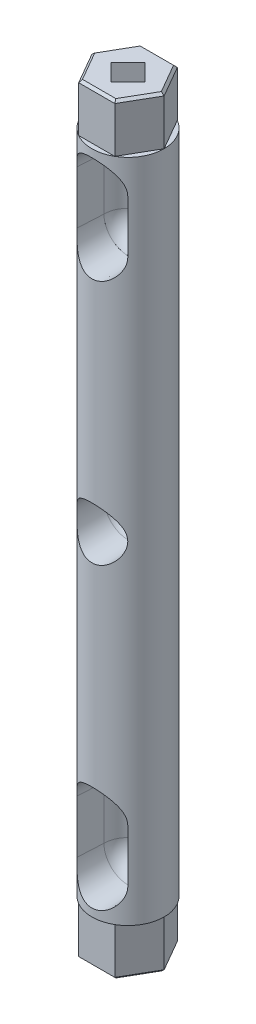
ISO-10303-21;
HEADER;
FILE_DESCRIPTION(('STEP AP214'),'2;1');
FILE_NAME('part.step','',(''),(''),'','','');
FILE_SCHEMA(('AUTOMOTIVE_DESIGN { 1 0 10303 214 1 1 1 1 }'));
ENDSEC;
DATA;
#1=APPLICATION_CONTEXT('core data for automotive mechanical design processes');
#2=APPLICATION_PROTOCOL_DEFINITION('international standard','automotive_design',2000,#1);
#3=PRODUCT_CONTEXT('',#1,'mechanical');
#4=PRODUCT('Part','Part','',(#3));
#5=PRODUCT_RELATED_PRODUCT_CATEGORY('part','',(#4));
#6=PRODUCT_DEFINITION_FORMATION('','',#4);
#7=PRODUCT_DEFINITION_CONTEXT('part definition',#1,'design');
#8=PRODUCT_DEFINITION('design','',#6,#7);
#9=PRODUCT_DEFINITION_SHAPE('','',#8);
#10=(LENGTH_UNIT() NAMED_UNIT(*) SI_UNIT(.MILLI.,.METRE.));
#11=(NAMED_UNIT(*) PLANE_ANGLE_UNIT() SI_UNIT($,.RADIAN.));
#12=(NAMED_UNIT(*) SI_UNIT($,.STERADIAN.) SOLID_ANGLE_UNIT());
#13=UNCERTAINTY_MEASURE_WITH_UNIT(LENGTH_MEASURE(1.E-05),#10,'distance_accuracy_value','');
#14=(GEOMETRIC_REPRESENTATION_CONTEXT(3) GLOBAL_UNCERTAINTY_ASSIGNED_CONTEXT((#13)) GLOBAL_UNIT_ASSIGNED_CONTEXT((#10,
#11,#12)) REPRESENTATION_CONTEXT('',''));
#15=CARTESIAN_POINT('',(0.,0.,0.));
#16=DIRECTION('',(0.,0.,1.));
#17=DIRECTION('',(1.,0.,0.));
#18=AXIS2_PLACEMENT_3D('',#15,#16,#17);
#19=CARTESIAN_POINT('',(0.,0.,0.));
#20=DIRECTION('',(0.,1.,0.));
#21=DIRECTION('',(0.,0.,1.));
#22=AXIS2_PLACEMENT_3D('',#19,#20,#21);
#23=PLANE('',#22);
#24=DIRECTION('',(0.499999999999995,0.,0.866025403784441));
#25=VECTOR('',#24,1.);
#26=CARTESIAN_POINT('',(3.75000000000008,0.,-6.49519052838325));
#27=LINE('',#26,#25);
#28=CARTESIAN_POINT('',(3.75000000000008,0.,-6.49519052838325));
#29=VERTEX_POINT('',#28);
#30=CARTESIAN_POINT('',(7.5,0.,0.));
#31=VERTEX_POINT('',#30);
#32=EDGE_CURVE('E329',#29,#31,#27,.T.);
#33=ORIENTED_EDGE('',*,*,#32,.F.);
#34=CARTESIAN_POINT('',(0.,0.,0.));
#35=DIRECTION('',(0.,1.,0.));
#36=DIRECTION('',(0.,0.,1.));
#37=AXIS2_PLACEMENT_3D('',#34,#35,#36);
#38=CIRCLE('',#37,7.5);
#39=EDGE_CURVE('E463',#31,#29,#38,.T.);
#40=ORIENTED_EDGE('',*,*,#39,.F.);
#41=EDGE_LOOP('',(#33,#40));
#42=FACE_BOUND('',#41,.T.);
#43=ADVANCED_FACE('F33',(#42),#23,.F.);
#44=DIRECTION('',(1.,0.,0.));
#45=VECTOR('',#44,1.);
#46=CARTESIAN_POINT('',(-3.74999999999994,0.,-6.49519052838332));
#47=LINE('',#46,#45);
#48=CARTESIAN_POINT('',(-3.74999999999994,0.,-6.49519052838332));
#49=VERTEX_POINT('',#48);
#50=EDGE_CURVE('E350',#49,#29,#47,.T.);
#51=ORIENTED_EDGE('',*,*,#50,.F.);
#52=EDGE_CURVE('E522',#29,#49,#38,.T.);
#53=ORIENTED_EDGE('',*,*,#52,.F.);
#54=EDGE_LOOP('',(#51,#53));
#55=FACE_BOUND('',#54,.T.);
#56=ADVANCED_FACE('F494',(#55),#23,.F.);
#57=DIRECTION('',(0.500000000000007,0.,-0.866025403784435));
#58=VECTOR('',#57,1.);
#59=CARTESIAN_POINT('',(-7.5,0.,0.));
#60=LINE('',#59,#58);
#61=CARTESIAN_POINT('',(-7.5,0.,0.));
#62=VERTEX_POINT('',#61);
#63=EDGE_CURVE('E347',#62,#49,#60,.T.);
#64=ORIENTED_EDGE('',*,*,#63,.F.);
#65=EDGE_CURVE('E624',#49,#62,#38,.T.);
#66=ORIENTED_EDGE('',*,*,#65,.F.);
#67=EDGE_LOOP('',(#64,#66));
#68=FACE_BOUND('',#67,.T.);
#69=ADVANCED_FACE('F500',(#68),#23,.F.);
#70=DIRECTION('',(-0.499999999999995,0.,-0.866025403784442));
#71=VECTOR('',#70,1.);
#72=CARTESIAN_POINT('',(-3.75000000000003,0.,6.49519052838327));
#73=LINE('',#72,#71);
#74=CARTESIAN_POINT('',(-3.75000000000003,0.,6.49519052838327));
#75=VERTEX_POINT('',#74);
#76=EDGE_CURVE('E344',#75,#62,#73,.T.);
#77=ORIENTED_EDGE('',*,*,#76,.F.);
#78=EDGE_CURVE('E620',#62,#75,#38,.T.);
#79=ORIENTED_EDGE('',*,*,#78,.F.);
#80=EDGE_LOOP('',(#77,#79));
#81=FACE_BOUND('',#80,.T.);
#82=ADVANCED_FACE('F512',(#81),#23,.F.);
#83=DIRECTION('',(-1.,0.,0.));
#84=VECTOR('',#83,1.);
#85=CARTESIAN_POINT('',(3.74999999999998,0.,6.4951905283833));
#86=LINE('',#85,#84);
#87=CARTESIAN_POINT('',(3.74999999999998,0.,6.4951905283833));
#88=VERTEX_POINT('',#87);
#89=EDGE_CURVE('E341',#88,#75,#86,.T.);
#90=ORIENTED_EDGE('',*,*,#89,.F.);
#91=EDGE_CURVE('E445',#75,#88,#38,.T.);
#92=ORIENTED_EDGE('',*,*,#91,.F.);
#93=EDGE_LOOP('',(#90,#92));
#94=FACE_BOUND('',#93,.T.);
#95=ADVANCED_FACE('F504',(#94),#23,.F.);
#96=DIRECTION('',(-0.500000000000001,0.,0.866025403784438));
#97=VECTOR('',#96,1.);
#98=CARTESIAN_POINT('',(7.5,0.,0.));
#99=LINE('',#98,#97);
#100=EDGE_CURVE('E338',#31,#88,#99,.T.);
#101=ORIENTED_EDGE('',*,*,#100,.F.);
#102=EDGE_CURVE('E460',#88,#31,#38,.T.);
#103=ORIENTED_EDGE('',*,*,#102,.F.);
#104=EDGE_LOOP('',(#101,#103));
#105=FACE_BOUND('',#104,.T.);
#106=ADVANCED_FACE('F496',(#105),#23,.F.);
#107=CARTESIAN_POINT('',(0.,138.16,0.));
#108=DIRECTION('',(0.,1.,0.));
#109=DIRECTION('',(0.,0.,1.));
#110=AXIS2_PLACEMENT_3D('',#107,#108,#109);
#111=PLANE('',#110);
#112=DIRECTION('',(0.499999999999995,0.,-0.866025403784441));
#113=VECTOR('',#112,1.);
#114=CARTESIAN_POINT('',(3.75000000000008,138.16,6.49519052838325));
#115=LINE('',#114,#113);
#116=CARTESIAN_POINT('',(3.75000000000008,138.16,6.49519052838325));
#117=VERTEX_POINT('',#116);
#118=CARTESIAN_POINT('',(7.5,138.16,0.));
#119=VERTEX_POINT('',#118);
#120=EDGE_CURVE('E365',#117,#119,#115,.T.);
#121=ORIENTED_EDGE('',*,*,#120,.F.);
#122=CARTESIAN_POINT('',(0.,138.16,0.));
#123=DIRECTION('',(0.,1.,0.));
#124=DIRECTION('',(0.,0.,1.));
#125=AXIS2_PLACEMENT_3D('',#122,#123,#124);
#126=CIRCLE('',#125,7.5);
#127=EDGE_CURVE('E454',#117,#119,#126,.T.);
#128=ORIENTED_EDGE('',*,*,#127,.T.);
#129=EDGE_LOOP('',(#121,#128));
#130=FACE_BOUND('',#129,.T.);
#131=ADVANCED_FACE('F491',(#130),#111,.T.);
#132=DIRECTION('',(1.,0.,0.));
#133=VECTOR('',#132,1.);
#134=CARTESIAN_POINT('',(-3.74999999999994,138.16,6.49519052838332));
#135=LINE('',#134,#133);
#136=CARTESIAN_POINT('',(-3.74999999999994,138.16,6.49519052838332));
#137=VERTEX_POINT('',#136);
#138=EDGE_CURVE('E380',#137,#117,#135,.T.);
#139=ORIENTED_EDGE('',*,*,#138,.F.);
#140=EDGE_CURVE('E459',#137,#117,#126,.T.);
#141=ORIENTED_EDGE('',*,*,#140,.T.);
#142=EDGE_LOOP('',(#139,#141));
#143=FACE_BOUND('',#142,.T.);
#144=ADVANCED_FACE('F510',(#143),#111,.T.);
#145=DIRECTION('',(0.500000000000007,0.,0.866025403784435));
#146=VECTOR('',#145,1.);
#147=CARTESIAN_POINT('',(-7.5,138.16,0.));
#148=LINE('',#147,#146);
#149=CARTESIAN_POINT('',(-7.5,138.16,0.));
#150=VERTEX_POINT('',#149);
#151=EDGE_CURVE('E377',#150,#137,#148,.T.);
#152=ORIENTED_EDGE('',*,*,#151,.F.);
#153=EDGE_CURVE('E1288',#150,#137,#126,.T.);
#154=ORIENTED_EDGE('',*,*,#153,.T.);
#155=EDGE_LOOP('',(#152,#154));
#156=FACE_BOUND('',#155,.T.);
#157=ADVANCED_FACE('F1019',(#156),#111,.T.);
#158=DIRECTION('',(-0.499999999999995,0.,0.866025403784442));
#159=VECTOR('',#158,1.);
#160=CARTESIAN_POINT('',(-3.75000000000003,138.16,-6.49519052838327));
#161=LINE('',#160,#159);
#162=CARTESIAN_POINT('',(-3.75000000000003,138.16,-6.49519052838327));
#163=VERTEX_POINT('',#162);
#164=EDGE_CURVE('E374',#163,#150,#161,.T.);
#165=ORIENTED_EDGE('',*,*,#164,.F.);
#166=EDGE_CURVE('E1298',#163,#150,#126,.T.);
#167=ORIENTED_EDGE('',*,*,#166,.T.);
#168=EDGE_LOOP('',(#165,#167));
#169=FACE_BOUND('',#168,.T.);
#170=ADVANCED_FACE('F1009',(#169),#111,.T.);
#171=DIRECTION('',(-1.,0.,0.));
#172=VECTOR('',#171,1.);
#173=CARTESIAN_POINT('',(3.74999999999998,138.16,-6.4951905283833));
#174=LINE('',#173,#172);
#175=CARTESIAN_POINT('',(3.74999999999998,138.16,-6.4951905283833));
#176=VERTEX_POINT('',#175);
#177=EDGE_CURVE('E371',#176,#163,#174,.T.);
#178=ORIENTED_EDGE('',*,*,#177,.F.);
#179=EDGE_CURVE('E1300',#176,#163,#126,.T.);
#180=ORIENTED_EDGE('',*,*,#179,.T.);
#181=EDGE_LOOP('',(#178,#180));
#182=FACE_BOUND('',#181,.T.);
#183=ADVANCED_FACE('F492',(#182),#111,.T.);
#184=CARTESIAN_POINT('',(0.,131.16,0.));
#185=DIRECTION('',(0.,0.,1.));
#186=DIRECTION('',(1.,0.,0.));
#187=AXIS2_PLACEMENT_3D('',#184,#185,#186);
#188=PLANE('',#187);
#189=CARTESIAN_POINT('',(0.,120.16,0.));
#190=DIRECTION('',(0.,0.,1.));
#191=DIRECTION('',(1.,0.,0.));
#192=AXIS2_PLACEMENT_3D('',#189,#190,#191);
#193=CIRCLE('',#192,5.);
#194=CARTESIAN_POINT('',(-4.99999434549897,120.160000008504,0.));
#195=VERTEX_POINT('',#194);
#196=CARTESIAN_POINT('',(4.99999434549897,120.160000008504,0.));
#197=VERTEX_POINT('',#196);
#198=EDGE_CURVE('E435',#195,#197,#193,.T.);
#199=ORIENTED_EDGE('',*,*,#198,.T.);
#200=CARTESIAN_POINT('',(0.,120.16751964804,0.));
#201=DIRECTION('',(0.,0.,1.));
#202=DIRECTION('',(1.,0.,0.));
#203=AXIS2_PLACEMENT_3D('',#200,#201,#202);
#204=CIRCLE('',#203,5.00000000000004);
#205=EDGE_CURVE('E1235',#197,#195,#204,.F.);
#206=ORIENTED_EDGE('',*,*,#205,.T.);
#207=EDGE_LOOP('',(#199,#206));
#208=FACE_BOUND('',#207,.T.);
#209=ADVANCED_FACE('F654',(#208),#188,.T.);
#210=CARTESIAN_POINT('',(0.,138.16,0.));
#211=DIRECTION('',(0.,-1.,0.));
#212=DIRECTION('',(0.,0.,-1.));
#213=AXIS2_PLACEMENT_3D('',#210,#211,#212);
#214=CYLINDRICAL_SURFACE('',#213,7.5);
#215=ORIENTED_EDGE('',*,*,#127,.F.);
#216=ORIENTED_EDGE('',*,*,#140,.F.);
#217=ORIENTED_EDGE('',*,*,#153,.F.);
#218=ORIENTED_EDGE('',*,*,#166,.F.);
#219=ORIENTED_EDGE('',*,*,#179,.F.);
#220=EDGE_CURVE('E458',#119,#176,#126,.T.);
#221=ORIENTED_EDGE('',*,*,#220,.F.);
#222=EDGE_LOOP('',(#215,#216,#217,#218,#219,#221));
#223=FACE_BOUND('',#222,.T.);
#224=ORIENTED_EDGE('',*,*,#102,.T.);
#225=ORIENTED_EDGE('',*,*,#39,.T.);
#226=ORIENTED_EDGE('',*,*,#52,.T.);
#227=ORIENTED_EDGE('',*,*,#65,.T.);
#228=ORIENTED_EDGE('',*,*,#78,.T.);
#229=ORIENTED_EDGE('',*,*,#91,.T.);
#230=EDGE_LOOP('',(#224,#225,#226,#227,#228,#229));
#231=FACE_BOUND('',#230,.T.);
#232=CARTESIAN_POINT('',(-4.00594290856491,65.5606569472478,6.34053794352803));
#233=CARTESIAN_POINT('',(-3.81657898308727,65.3356083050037,6.46017213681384));
#234=CARTESIAN_POINT('',(-3.60832269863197,65.1258626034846,6.57982250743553));
#235=CARTESIAN_POINT('',(-3.15591270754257,64.7413456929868,6.80842307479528));
#236=CARTESIAN_POINT('',(-2.91170202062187,64.5666310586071,6.9173558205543));
#237=CARTESIAN_POINT('',(-2.4298006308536,64.2819832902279,7.09942622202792));
#238=CARTESIAN_POINT('',(-2.19670206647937,64.1662503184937,7.17548552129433));
#239=CARTESIAN_POINT('',(-1.83251894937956,64.0187341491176,7.2737719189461));
#240=CARTESIAN_POINT('',(-1.70870826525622,63.9739108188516,7.30389923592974));
#241=CARTESIAN_POINT('',(-1.45689149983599,63.8934869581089,7.35826220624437));
#242=CARTESIAN_POINT('',(-1.32888729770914,63.8578823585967,7.38250045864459));
#243=CARTESIAN_POINT('',(-1.06865482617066,63.7962057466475,7.42465296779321));
#244=CARTESIAN_POINT('',(-0.936404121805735,63.7701987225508,7.44252408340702));
#245=CARTESIAN_POINT('',(-0.66952730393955,63.7284764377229,7.47126095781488));
#246=CARTESIAN_POINT('',(-0.534901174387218,63.7127612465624,7.48212666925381));
#247=CARTESIAN_POINT('',(-0.264470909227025,63.6919042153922,7.4965583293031));
#248=CARTESIAN_POINT('',(-0.12866704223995,63.6867600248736,7.50012590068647));
#249=CARTESIAN_POINT('',(0.142912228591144,63.687133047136,7.49986733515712));
#250=CARTESIAN_POINT('',(0.278687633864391,63.6926493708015,7.49604181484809));
#251=CARTESIAN_POINT('',(0.534897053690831,63.713112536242,7.48188449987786));
#252=CARTESIAN_POINT('',(0.655456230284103,63.7270174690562,7.47227174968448));
#253=CARTESIAN_POINT('',(0.894778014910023,63.763104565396,7.44740565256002));
#254=CARTESIAN_POINT('',(1.01354001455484,63.785289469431,7.43215043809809));
#255=CARTESIAN_POINT('',(1.24843464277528,63.8376360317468,7.39631781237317));
#256=CARTESIAN_POINT('',(1.36456803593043,63.8677953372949,7.37574197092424));
#257=CARTESIAN_POINT('',(1.59360522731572,63.9357227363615,7.32967237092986));
#258=CARTESIAN_POINT('',(1.70650775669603,63.973493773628,7.30417670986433));
#259=CARTESIAN_POINT('',(2.04673262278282,64.1003248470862,7.21917944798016));
#260=CARTESIAN_POINT('',(2.26796762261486,64.2011928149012,7.15236123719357));
#261=CARTESIAN_POINT('',(2.69057048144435,64.429809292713,7.00436507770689));
#262=CARTESIAN_POINT('',(2.89193375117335,64.557563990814,6.92318382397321));
#263=CARTESIAN_POINT('',(3.30341839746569,64.8588511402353,6.73766175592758));
#264=CARTESIAN_POINT('',(3.50983524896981,65.036433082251,6.63169122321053));
#265=CARTESIAN_POINT('',(3.892356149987,65.4196933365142,6.41467082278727));
#266=CARTESIAN_POINT('',(4.06840349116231,65.6254229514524,6.30361193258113));
#267=CARTESIAN_POINT('',(4.32195085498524,65.9716380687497,6.13054855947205));
#268=CARTESIAN_POINT('',(4.41005981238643,66.1038381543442,6.06728499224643));
#269=CARTESIAN_POINT('',(4.57485336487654,66.3766109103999,5.94401532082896));
#270=CARTESIAN_POINT('',(4.65153497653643,66.5171857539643,5.88401006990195));
#271=CARTESIAN_POINT('',(4.86328908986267,66.9505066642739,5.7123766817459));
#272=CARTESIAN_POINT('',(4.9807023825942,67.2557051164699,5.60867638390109));
#273=CARTESIAN_POINT('',(5.13250982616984,67.7926269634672,5.46942063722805));
#274=CARTESIAN_POINT('',(5.18139476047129,68.0173396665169,5.42269238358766));
#275=CARTESIAN_POINT('',(5.23355498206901,68.3602707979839,5.37219109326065));
#276=CARTESIAN_POINT('',(5.24741238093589,68.4755051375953,5.35862421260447));
#277=CARTESIAN_POINT('',(5.26788720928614,68.7072477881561,5.33850037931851));
#278=CARTESIAN_POINT('',(5.27450453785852,68.8237561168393,5.33194352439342));
#279=CARTESIAN_POINT('',(5.2803806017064,69.0574819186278,5.3261238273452));
#280=CARTESIAN_POINT('',(5.27961768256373,69.1747004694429,5.32688244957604));
#281=CARTESIAN_POINT('',(5.27069763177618,69.4085743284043,5.33570854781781));
#282=CARTESIAN_POINT('',(5.2625405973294,69.5252296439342,5.34377592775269));
#283=CARTESIAN_POINT('',(5.23896559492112,69.7572207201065,5.3668901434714));
#284=CARTESIAN_POINT('',(5.22354008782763,69.8725549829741,5.38194422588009));
#285=CARTESIAN_POINT('',(5.1856670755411,70.1010817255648,5.41844494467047));
#286=CARTESIAN_POINT('',(5.16321592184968,70.2142730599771,5.43989490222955));
#287=CARTESIAN_POINT('',(5.10592693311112,70.4624404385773,5.49375798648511));
#288=CARTESIAN_POINT('',(5.06945163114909,70.5967414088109,5.52754424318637));
#289=CARTESIAN_POINT('',(4.98707508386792,70.8605225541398,5.60197822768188));
#290=CARTESIAN_POINT('',(4.94116746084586,70.9899993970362,5.6426305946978));
#291=CARTESIAN_POINT('',(4.84042597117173,71.2437155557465,5.72928348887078));
#292=CARTESIAN_POINT('',(4.78558382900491,71.3679498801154,5.77528896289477));
#293=CARTESIAN_POINT('',(4.66747277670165,71.6107173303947,5.87115774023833));
#294=CARTESIAN_POINT('',(4.60420532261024,71.7292514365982,5.92102037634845));
#295=CARTESIAN_POINT('',(4.39951824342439,72.080791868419,6.07650489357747));
#296=CARTESIAN_POINT('',(4.24524202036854,72.3046636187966,6.18619251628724));
#297=CARTESIAN_POINT('',(3.90482732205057,72.7263648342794,6.40651846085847));
#298=CARTESIAN_POINT('',(3.71867199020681,72.9241804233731,6.51715725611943));
#299=CARTESIAN_POINT('',(3.39757331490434,73.2164737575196,6.68767128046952));
#300=CARTESIAN_POINT('',(3.27238997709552,73.3203756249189,6.7499712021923));
#301=CARTESIAN_POINT('',(3.01155136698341,73.5170536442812,6.87031077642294));
#302=CARTESIAN_POINT('',(2.87589402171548,73.6098275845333,6.92834958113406));
#303=CARTESIAN_POINT('',(2.59490010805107,73.7830227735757,7.0384113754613));
#304=CARTESIAN_POINT('',(2.44957795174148,73.8634618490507,7.09044301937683));
#305=CARTESIAN_POINT('',(2.14992614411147,74.0109289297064,7.18697138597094));
#306=CARTESIAN_POINT('',(1.99560067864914,74.0779631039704,7.23147157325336));
#307=CARTESIAN_POINT('',(1.723342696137,74.1807102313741,7.30027026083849));
#308=CARTESIAN_POINT('',(1.60727372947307,74.2199432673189,7.32674068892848));
#309=CARTESIAN_POINT('',(1.37167989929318,74.2903516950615,7.37447814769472));
#310=CARTESIAN_POINT('',(1.25215575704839,74.3215287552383,7.39574625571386));
#311=CARTESIAN_POINT('',(1.01043988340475,74.3754073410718,7.43262725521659));
#312=CARTESIAN_POINT('',(0.888250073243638,74.3981147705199,7.44824408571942));
#313=CARTESIAN_POINT('',(0.641942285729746,74.4347654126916,7.47350217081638));
#314=CARTESIAN_POINT('',(0.517824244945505,74.448708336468,7.4831432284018));
#315=CARTESIAN_POINT('',(0.268273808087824,74.4676414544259,7.49624427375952));
#316=CARTESIAN_POINT('',(0.142838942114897,74.4726096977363,7.4996891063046));
#317=CARTESIAN_POINT('',(-0.108121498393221,74.4734490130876,7.50027071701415));
#318=CARTESIAN_POINT('',(-0.233647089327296,74.4693167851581,7.49740520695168));
#319=CARTESIAN_POINT('',(-0.483746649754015,74.4520146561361,7.48542984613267));
#320=CARTESIAN_POINT('',(-0.608320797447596,74.4388464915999,7.47632119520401));
#321=CARTESIAN_POINT('',(-0.855661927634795,74.4036682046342,7.45206634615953));
#322=CARTESIAN_POINT('',(-0.978428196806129,74.3816546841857,7.43691782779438));
#323=CARTESIAN_POINT('',(-1.21693920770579,74.3300350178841,7.40155855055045));
#324=CARTESIAN_POINT('',(-1.33277832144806,74.3007270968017,7.38154722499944));
#325=CARTESIAN_POINT('',(-1.5613128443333,74.2345383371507,7.33661286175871));
#326=CARTESIAN_POINT('',(-1.67400715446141,74.1976548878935,7.31168813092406));
#327=CARTESIAN_POINT('',(-2.00643914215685,74.0762527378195,7.23022363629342));
#328=CARTESIAN_POINT('',(-2.22069950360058,73.980943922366,7.1669668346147));
#329=CARTESIAN_POINT('',(-2.65217136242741,73.75392433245,7.01949316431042));
#330=CARTESIAN_POINT('',(-2.86740986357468,73.6194737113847,6.93378775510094));
#331=CARTESIAN_POINT('',(-3.27359765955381,73.3238498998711,6.75153382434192));
#332=CARTESIAN_POINT('',(-3.46452644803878,73.1626544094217,6.65497627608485));
#333=CARTESIAN_POINT('',(-3.85361572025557,72.7846470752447,6.43876878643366));
#334=CARTESIAN_POINT('',(-4.04663704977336,72.5630595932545,6.31814002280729));
#335=CARTESIAN_POINT('',(-4.30769973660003,72.208401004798,6.14043040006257));
#336=CARTESIAN_POINT('',(-4.39001671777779,72.0863883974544,6.08169839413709));
#337=CARTESIAN_POINT('',(-4.54486895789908,71.8351477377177,5.96686243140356));
#338=CARTESIAN_POINT('',(-4.6174047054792,71.7059200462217,5.91075834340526));
#339=CARTESIAN_POINT('',(-4.7995935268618,71.3472810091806,5.76501871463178));
#340=CARTESIAN_POINT('',(-4.89965962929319,71.1110959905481,5.67942073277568));
#341=CARTESIAN_POINT('',(-5.02513155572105,70.7437135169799,5.56787266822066));
#342=CARTESIAN_POINT('',(-5.06284082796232,70.6191209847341,5.53350851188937));
#343=CARTESIAN_POINT('',(-5.12963025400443,70.3659984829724,5.47165088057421));
#344=CARTESIAN_POINT('',(-5.15871559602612,70.237470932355,5.44415327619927));
#345=CARTESIAN_POINT('',(-5.20398770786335,69.9974027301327,5.40086436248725));
#346=CARTESIAN_POINT('',(-5.22147436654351,69.8863133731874,5.38391971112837));
#347=CARTESIAN_POINT('',(-5.24969818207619,69.6625369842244,5.3564036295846));
#348=CARTESIAN_POINT('',(-5.26043848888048,69.5498507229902,5.34582922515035));
#349=CARTESIAN_POINT('',(-5.27500075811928,69.3236637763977,5.33146068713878));
#350=CARTESIAN_POINT('',(-5.27882676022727,69.2101636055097,5.32766259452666));
#351=CARTESIAN_POINT('',(-5.27950736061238,68.9831194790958,5.32698806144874));
#352=CARTESIAN_POINT('',(-5.27636179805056,68.8695755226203,5.33011178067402));
#353=CARTESIAN_POINT('',(-5.26316414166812,68.6434999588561,5.34314418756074));
#354=CARTESIAN_POINT('',(-5.25312516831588,68.5309668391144,5.35303998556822));
#355=CARTESIAN_POINT('',(-5.22632184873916,68.3074387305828,5.37921002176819));
#356=CARTESIAN_POINT('',(-5.20955505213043,68.1964443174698,5.39548658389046));
#357=CARTESIAN_POINT('',(-5.14944933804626,67.8664786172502,5.453101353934));
#358=CARTESIAN_POINT('',(-5.09631855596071,67.6507446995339,5.50321016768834));
#359=CARTESIAN_POINT('',(-4.94291006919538,67.1561515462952,5.64195963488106));
#360=CARTESIAN_POINT('',(-4.83254029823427,66.8825775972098,5.73797899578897));
#361=CARTESIAN_POINT('',(-4.57295040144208,66.3622072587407,5.94691487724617));
#362=CARTESIAN_POINT('',(-4.42376205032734,66.1153892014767,6.05981754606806));
#363=CARTESIAN_POINT('',(-4.21697564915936,65.8276259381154,6.20237630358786));
#364=CARTESIAN_POINT('',(-4.1761787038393,65.7730784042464,6.22993122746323));
#365=CARTESIAN_POINT('',(-4.09257247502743,65.6656332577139,6.28516980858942));
#366=CARTESIAN_POINT('',(-4.04976353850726,65.6127353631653,6.3128534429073));
#367=CARTESIAN_POINT('',(-4.00594290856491,65.5606569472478,6.34053794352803));
#368=B_SPLINE_CURVE_WITH_KNOTS('',3,(#232,#233,#234,#235,#236,#237,#238,#239,#240,#241,#242,
#243,#244,#245,#246,#247,#248,#249,#250,#251,#252,#253,#254,#255,#256,#257,#258,#259,#260,#261,
#262,#263,#264,#265,#266,#267,#268,#269,#270,#271,#272,#273,#274,#275,#276,#277,#278,#279,#280,
#281,#282,#283,#284,#285,#286,#287,#288,#289,#290,#291,#292,#293,#294,#295,#296,#297,#298,#299,
#300,#301,#302,#303,#304,#305,#306,#307,#308,#309,#310,#311,#312,#313,#314,#315,#316,#317,#318,
#319,#320,#321,#322,#323,#324,#325,#326,#327,#328,#329,#330,#331,#332,#333,#334,#335,#336,#337,
#338,#339,#340,#341,#342,#343,#344,#345,#346,#347,#348,#349,#350,#351,#352,#353,#354,#355,#356,
#357,#358,#359,#360,#361,#362,#363,#364,#365,#366,#367),.UNSPECIFIED.,.T.,.F.,(4,2,2,2,2,2,2,2,
2,2,2,2,2,2,2,2,2,2,2,2,2,2,2,2,2,2,2,2,2,2,2,2,2,2,2,2,2,2,2,2,2,2,2,2,2,2,2,2,2,2,2,2,2,2,2,2,
2,2,2,2,2,2,2,2,2,2,2,4),(0.,0.952308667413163,1.90614312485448,2.71582934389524,
3.12063395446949,3.52525958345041,3.93257686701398,4.33989690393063,4.74712636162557,
5.15432185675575,5.51911241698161,5.88402382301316,6.24882768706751,6.6137729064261,
7.36705901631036,8.12051868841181,8.99386563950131,9.8688261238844,10.3812597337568,
10.8938268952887,11.9155344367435,12.6165078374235,12.9666802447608,13.3168575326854,
13.6680625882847,14.0192630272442,14.3708285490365,14.7225769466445,15.1515748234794,
15.5808637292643,16.010552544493,16.4401671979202,17.3165134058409,18.1933244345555,
18.7153201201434,19.2374193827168,19.7587568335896,20.2798538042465,20.6555193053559,
21.0311069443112,21.4064322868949,21.781770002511,22.1580245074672,22.5344154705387,
22.9107341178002,23.2871974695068,23.6502575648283,24.0134429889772,24.739280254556,
25.5399470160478,26.341284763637,27.2901411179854,27.7651416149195,28.2401183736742,
29.047774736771,29.4512802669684,29.8545425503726,30.1953629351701,30.5360240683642,
30.8764861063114,31.2169559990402,31.5567796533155,31.8967271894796,32.5772765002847,
33.503201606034,34.4283711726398,34.64878241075,34.8691557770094),.UNSPECIFIED.);
#369=CARTESIAN_POINT('',(-4.00594290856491,65.5606569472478,6.34053794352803));
#370=VERTEX_POINT('',#369);
#371=EDGE_CURVE('E457',#370,#370,#368,.T.);
#372=ORIENTED_EDGE('',*,*,#371,.F.);
#373=EDGE_LOOP('',(#372));
#374=FACE_BOUND('',#373,.T.);
#375=CARTESIAN_POINT('',(-5.27919199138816,120.1602,5.32730062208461));
#376=CARTESIAN_POINT('',(-5.27922928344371,120.030235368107,5.32721822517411));
#377=CARTESIAN_POINT('',(-5.27464075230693,119.900315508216,5.33181026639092));
#378=CARTESIAN_POINT('',(-5.25647253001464,119.64189342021,5.34974639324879));
#379=CARTESIAN_POINT('',(-5.24290562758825,119.513389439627,5.36307803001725));
#380=CARTESIAN_POINT('',(-5.20722208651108,119.260045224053,5.39772266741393));
#381=CARTESIAN_POINT('',(-5.18519374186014,119.135181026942,5.41895317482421));
#382=CARTESIAN_POINT('',(-5.13297076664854,118.888574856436,5.46844693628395));
#383=CARTESIAN_POINT('',(-5.10277356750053,118.766833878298,5.49671240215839));
#384=CARTESIAN_POINT('',(-5.03482466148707,118.527784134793,5.55901472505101));
#385=CARTESIAN_POINT('',(-4.99711582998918,118.410454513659,5.59301866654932));
#386=CARTESIAN_POINT('',(-4.9144559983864,118.179949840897,5.66578872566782));
#387=CARTESIAN_POINT('',(-4.86950542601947,118.066774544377,5.70455456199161));
#388=CARTESIAN_POINT('',(-4.72402294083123,117.733192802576,5.82662855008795));
#389=CARTESIAN_POINT('',(-4.61301856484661,117.51927905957,5.91556110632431));
#390=CARTESIAN_POINT('',(-4.41616329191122,117.194249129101,6.06266169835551));
#391=CARTESIAN_POINT('',(-4.33860431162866,117.076884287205,6.11852881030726));
#392=CARTESIAN_POINT('',(-4.17481722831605,116.848958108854,6.23143692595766));
#393=CARTESIAN_POINT('',(-4.0885883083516,116.738397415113,6.28847803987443));
#394=CARTESIAN_POINT('',(-3.81706268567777,116.417206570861,6.45954106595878));
#395=CARTESIAN_POINT('',(-3.61891931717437,116.217054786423,6.57350873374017));
#396=CARTESIAN_POINT('',(-3.28166620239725,115.927141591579,6.74535810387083));
#397=CARTESIAN_POINT('',(-3.15324582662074,115.826610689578,6.80649502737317));
#398=CARTESIAN_POINT('',(-2.88606496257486,115.636966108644,6.92400842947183));
#399=CARTESIAN_POINT('',(-2.74730257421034,115.547854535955,6.98038402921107));
#400=CARTESIAN_POINT('',(-2.46036802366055,115.382360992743,7.08660452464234));
#401=CARTESIAN_POINT('',(-2.31221268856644,115.305957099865,7.13646063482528));
#402=CARTESIAN_POINT('',(-2.0072281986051,115.166935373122,7.22816363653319));
#403=CARTESIAN_POINT('',(-1.85040321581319,115.104310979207,7.27001433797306));
#404=CARTESIAN_POINT('',(-1.57520465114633,115.009797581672,7.33366325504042));
#405=CARTESIAN_POINT('',(-1.45861274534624,114.974235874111,7.35777694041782));
#406=CARTESIAN_POINT('',(-1.22231345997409,114.911203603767,7.40069976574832));
#407=CARTESIAN_POINT('',(-1.10260672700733,114.88373137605,7.41950999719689));
#408=CARTESIAN_POINT('',(-0.860888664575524,114.837253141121,7.45142426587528));
#409=CARTESIAN_POINT('',(-0.738878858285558,114.818241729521,7.46453194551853));
#410=CARTESIAN_POINT('',(-0.493316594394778,114.788929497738,7.48477219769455));
#411=CARTESIAN_POINT('',(-0.369764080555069,114.778628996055,7.49190455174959));
#412=CARTESIAN_POINT('',(-0.121815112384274,114.766884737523,7.50003828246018));
#413=CARTESIAN_POINT('',(0.00258245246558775,114.765456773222,7.50102872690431));
#414=CARTESIAN_POINT('',(0.251099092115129,114.771522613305,7.49682597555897));
#415=CARTESIAN_POINT('',(0.375218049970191,114.779019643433,7.49163054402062));
#416=CARTESIAN_POINT('',(0.622180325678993,114.802824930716,7.47517260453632));
#417=CARTESIAN_POINT('',(0.745023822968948,114.819131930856,7.46391096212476));
#418=CARTESIAN_POINT('',(0.988624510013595,114.86032486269,7.43556766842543));
#419=CARTESIAN_POINT('',(1.10938087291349,114.885214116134,7.4184837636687));
#420=CARTESIAN_POINT('',(1.34523204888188,114.942564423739,7.37931618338));
#421=CARTESIAN_POINT('',(1.46039319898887,114.974838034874,7.35735662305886));
#422=CARTESIAN_POINT('',(1.68732938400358,115.046867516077,7.30865314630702));
#423=CARTESIAN_POINT('',(1.79910323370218,115.08662597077,7.28190757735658));
#424=CARTESIAN_POINT('',(2.12846228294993,115.216489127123,7.19521205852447));
#425=CARTESIAN_POINT('',(2.3402546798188,115.317223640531,7.12877407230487));
#426=CARTESIAN_POINT('',(2.76829724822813,115.556497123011,6.97453491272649));
#427=CARTESIAN_POINT('',(2.98227207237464,115.698047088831,6.88515740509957));
#428=CARTESIAN_POINT('',(3.38495196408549,116.007972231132,6.69639104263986));
#429=CARTESIAN_POINT('',(3.57363258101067,116.176373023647,6.59699266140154));
#430=CARTESIAN_POINT('',(3.95699638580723,116.570553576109,6.37570893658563));
#431=CARTESIAN_POINT('',(4.14631327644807,116.801183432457,6.25306971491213));
#432=CARTESIAN_POINT('',(4.40061744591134,117.16976456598,6.0741580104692));
#433=CARTESIAN_POINT('',(4.48047952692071,117.296480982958,6.01532798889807));
#434=CARTESIAN_POINT('',(4.62995895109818,117.557246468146,5.90104355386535));
#435=CARTESIAN_POINT('',(4.69957739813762,117.691294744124,5.84558877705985));
#436=CARTESIAN_POINT('',(4.8683591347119,118.052812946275,5.70678287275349));
#437=CARTESIAN_POINT('',(4.95874587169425,118.286247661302,5.62769269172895));
#438=CARTESIAN_POINT('',(5.07049987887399,118.648001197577,5.52653256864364));
#439=CARTESIAN_POINT('',(5.10375169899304,118.770348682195,5.49575446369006));
#440=CARTESIAN_POINT('',(5.16198045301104,119.018486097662,5.44109807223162));
#441=CARTESIAN_POINT('',(5.18696091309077,119.144274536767,5.41721684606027));
#442=CARTESIAN_POINT('',(5.23120220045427,119.416884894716,5.37453464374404));
#443=CARTESIAN_POINT('',(5.24912158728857,119.564127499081,5.35696025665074));
#444=CARTESIAN_POINT('',(5.26712559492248,119.786588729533,5.33923687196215));
#445=CARTESIAN_POINT('',(5.27164784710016,119.861146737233,5.33476856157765));
#446=CARTESIAN_POINT('',(5.27768382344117,120.010530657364,5.32879563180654));
#447=CARTESIAN_POINT('',(5.27919641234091,120.085356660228,5.32729213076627));
#448=CARTESIAN_POINT('',(5.27919199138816,120.1602,5.32730062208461));
#449=B_SPLINE_CURVE_WITH_KNOTS('',3,(#375,#376,#377,#378,#379,#380,#381,#382,#383,#384,#385,
#386,#387,#388,#389,#390,#391,#392,#393,#394,#395,#396,#397,#398,#399,#400,#401,#402,#403,#404,
#405,#406,#407,#408,#409,#410,#411,#412,#413,#414,#415,#416,#417,#418,#419,#420,#421,#422,#423,
#424,#425,#426,#427,#428,#429,#430,#431,#432,#433,#434,#435,#436,#437,#438,#439,#440,#441,#442,
#443,#444,#445,#446,#447,#448),.UNSPECIFIED.,.F.,.F.,(4,2,2,2,2,2,2,2,2,2,2,2,2,2,2,2,2,2,2,2,2,
2,2,2,2,2,2,2,2,2,2,2,2,2,2,2,4),(0.,0.389659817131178,0.778765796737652,1.16391721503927,
1.54918988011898,1.9323234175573,2.31543433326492,3.08341276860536,3.53716210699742,
3.99095424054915,4.89849025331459,5.4204146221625,5.9424351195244,6.46354550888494,
6.98440727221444,7.3568007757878,7.72911758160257,8.10119622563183,8.47328847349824,
8.84604283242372,9.21893195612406,9.5917678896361,9.96474829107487,10.3291447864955,
10.6936673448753,11.4221863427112,12.234271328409,13.0471357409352,14.0106241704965,
14.4929508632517,14.9752255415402,15.7593189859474,16.1503257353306,16.5411655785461,
16.9882808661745,17.2126620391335,17.4371278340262),.UNSPECIFIED.);
#450=CARTESIAN_POINT('',(-5.27919199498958,120.16,5.32730061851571));
#451=VERTEX_POINT('',#450);
#452=CARTESIAN_POINT('',(5.27919199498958,120.16,5.32730061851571));
#453=VERTEX_POINT('',#452);
#454=EDGE_CURVE('E470',#451,#453,#449,.T.);
#455=ORIENTED_EDGE('',*,*,#454,.F.);
#456=DIRECTION('',(0.,-1.,0.));
#457=VECTOR('',#456,1.);
#458=CARTESIAN_POINT('',(-5.27919199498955,138.16,5.32730061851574));
#459=LINE('',#458,#457);
#460=CARTESIAN_POINT('',(-5.27919199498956,131.16,5.32730061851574));
#461=VERTEX_POINT('',#460);
#462=EDGE_CURVE('E1215',#461,#451,#459,.T.);
#463=ORIENTED_EDGE('',*,*,#462,.F.);
#464=CARTESIAN_POINT('',(5.27919199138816,131.1598,5.32730062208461));
#465=CARTESIAN_POINT('',(5.27922928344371,131.289764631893,5.32721822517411));
#466=CARTESIAN_POINT('',(5.27464075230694,131.419684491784,5.33181026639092));
#467=CARTESIAN_POINT('',(5.25647253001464,131.67810657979,5.3497463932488));
#468=CARTESIAN_POINT('',(5.24290562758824,131.806610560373,5.36307803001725));
#469=CARTESIAN_POINT('',(5.20722208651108,132.059954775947,5.39772266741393));
#470=CARTESIAN_POINT('',(5.18519374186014,132.184818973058,5.4189531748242));
#471=CARTESIAN_POINT('',(5.13297076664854,132.431425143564,5.46844693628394));
#472=CARTESIAN_POINT('',(5.10277356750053,132.553166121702,5.49671240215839));
#473=CARTESIAN_POINT('',(5.03482466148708,132.792215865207,5.559014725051));
#474=CARTESIAN_POINT('',(4.9971158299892,132.909545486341,5.59301866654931));
#475=CARTESIAN_POINT('',(4.91445599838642,133.140050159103,5.66578872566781));
#476=CARTESIAN_POINT('',(4.86950542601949,133.253225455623,5.7045545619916));
#477=CARTESIAN_POINT('',(4.72402294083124,133.586807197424,5.82662855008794));
#478=CARTESIAN_POINT('',(4.61301856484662,133.80072094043,5.91556110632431));
#479=CARTESIAN_POINT('',(4.41616329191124,134.125750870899,6.0626616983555));
#480=CARTESIAN_POINT('',(4.33860431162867,134.243115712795,6.11852881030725));
#481=CARTESIAN_POINT('',(4.17481722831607,134.471041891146,6.23143692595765));
#482=CARTESIAN_POINT('',(4.08858830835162,134.581602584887,6.28847803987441));
#483=CARTESIAN_POINT('',(3.81706268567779,134.902793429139,6.45954106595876));
#484=CARTESIAN_POINT('',(3.61891931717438,135.102945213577,6.57350873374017));
#485=CARTESIAN_POINT('',(3.28166620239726,135.392858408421,6.74535810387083));
#486=CARTESIAN_POINT('',(3.15324582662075,135.493389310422,6.80649502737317));
#487=CARTESIAN_POINT('',(2.88606496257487,135.683033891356,6.92400842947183));
#488=CARTESIAN_POINT('',(2.74730257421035,135.772145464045,6.98038402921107));
#489=CARTESIAN_POINT('',(2.46036802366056,135.937639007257,7.08660452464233));
#490=CARTESIAN_POINT('',(2.31221268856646,136.014042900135,7.13646063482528));
#491=CARTESIAN_POINT('',(2.00722819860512,136.153064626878,7.22816363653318));
#492=CARTESIAN_POINT('',(1.85040321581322,136.215689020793,7.27001433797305));
#493=CARTESIAN_POINT('',(1.57520465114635,136.310202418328,7.33366325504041));
#494=CARTESIAN_POINT('',(1.45861274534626,136.345764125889,7.35777694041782));
#495=CARTESIAN_POINT('',(1.22231345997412,136.408796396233,7.40069976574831));
#496=CARTESIAN_POINT('',(1.10260672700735,136.43626862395,7.41950999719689));
#497=CARTESIAN_POINT('',(0.860888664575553,136.482746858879,7.45142426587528));
#498=CARTESIAN_POINT('',(0.738878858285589,136.501758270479,7.46453194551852));
#499=CARTESIAN_POINT('',(0.493316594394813,136.531070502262,7.48477219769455));
#500=CARTESIAN_POINT('',(0.369764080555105,136.541371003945,7.49190455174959));
#501=CARTESIAN_POINT('',(0.121815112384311,136.553115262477,7.50003828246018));
#502=CARTESIAN_POINT('',(-0.00258245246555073,136.554543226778,7.50102872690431));
#503=CARTESIAN_POINT('',(-0.251099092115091,136.548477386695,7.49682597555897));
#504=CARTESIAN_POINT('',(-0.375218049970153,136.540980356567,7.49163054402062));
#505=CARTESIAN_POINT('',(-0.622180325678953,136.517175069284,7.47517260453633));
#506=CARTESIAN_POINT('',(-0.745023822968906,136.500868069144,7.46391096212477));
#507=CARTESIAN_POINT('',(-0.988624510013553,136.459675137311,7.43556766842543));
#508=CARTESIAN_POINT('',(-1.10938087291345,136.434785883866,7.4184837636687));
#509=CARTESIAN_POINT('',(-1.34523204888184,136.377435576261,7.37931618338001));
#510=CARTESIAN_POINT('',(-1.46039319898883,136.345161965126,7.35735662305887));
#511=CARTESIAN_POINT('',(-1.68732938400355,136.273132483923,7.30865314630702));
#512=CARTESIAN_POINT('',(-1.79910323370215,136.23337402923,7.28190757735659));
#513=CARTESIAN_POINT('',(-2.1284622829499,136.103510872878,7.19521205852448));
#514=CARTESIAN_POINT('',(-2.34025467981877,136.002776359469,7.12877407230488));
#515=CARTESIAN_POINT('',(-2.76829724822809,135.763502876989,6.97453491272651));
#516=CARTESIAN_POINT('',(-2.9822720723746,135.621952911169,6.88515740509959));
#517=CARTESIAN_POINT('',(-3.38495196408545,135.312027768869,6.69639104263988));
#518=CARTESIAN_POINT('',(-3.57363258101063,135.143626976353,6.59699266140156));
#519=CARTESIAN_POINT('',(-3.95699638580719,134.749446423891,6.37570893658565));
#520=CARTESIAN_POINT('',(-4.14631327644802,134.518816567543,6.25306971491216));
#521=CARTESIAN_POINT('',(-4.4006174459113,134.15023543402,6.07415801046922));
#522=CARTESIAN_POINT('',(-4.48047952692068,134.023519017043,6.01532798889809));
#523=CARTESIAN_POINT('',(-4.62995895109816,133.762753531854,5.90104355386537));
#524=CARTESIAN_POINT('',(-4.69957739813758,133.628705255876,5.84558877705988));
#525=CARTESIAN_POINT('',(-4.86835913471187,133.267187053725,5.70678287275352));
#526=CARTESIAN_POINT('',(-4.95874587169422,133.033752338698,5.62769269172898));
#527=CARTESIAN_POINT('',(-5.07049987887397,132.671998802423,5.52653256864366));
#528=CARTESIAN_POINT('',(-5.10375169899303,132.549651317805,5.49575446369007));
#529=CARTESIAN_POINT('',(-5.16198045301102,132.301513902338,5.44109807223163));
#530=CARTESIAN_POINT('',(-5.18696091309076,132.175725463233,5.41721684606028));
#531=CARTESIAN_POINT('',(-5.23120220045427,131.903115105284,5.37453464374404));
#532=CARTESIAN_POINT('',(-5.24912158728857,131.755872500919,5.35696025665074));
#533=CARTESIAN_POINT('',(-5.26712559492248,131.533411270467,5.33923687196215));
#534=CARTESIAN_POINT('',(-5.27164784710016,131.458853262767,5.33476856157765));
#535=CARTESIAN_POINT('',(-5.27768382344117,131.309469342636,5.32879563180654));
#536=CARTESIAN_POINT('',(-5.27919641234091,131.234643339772,5.32729213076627));
#537=CARTESIAN_POINT('',(-5.27919199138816,131.1598,5.32730062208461));
#538=B_SPLINE_CURVE_WITH_KNOTS('',3,(#464,#465,#466,#467,#468,#469,#470,#471,#472,#473,#474,
#475,#476,#477,#478,#479,#480,#481,#482,#483,#484,#485,#486,#487,#488,#489,#490,#491,#492,#493,
#494,#495,#496,#497,#498,#499,#500,#501,#502,#503,#504,#505,#506,#507,#508,#509,#510,#511,#512,
#513,#514,#515,#516,#517,#518,#519,#520,#521,#522,#523,#524,#525,#526,#527,#528,#529,#530,#531,
#532,#533,#534,#535,#536,#537),.UNSPECIFIED.,.F.,.F.,(4,2,2,2,2,2,2,2,2,2,2,2,2,2,2,2,2,2,2,2,2,
2,2,2,2,2,2,2,2,2,2,2,2,2,2,2,4),(0.,0.389659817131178,0.778765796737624,1.16391721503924,
1.54918988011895,1.93232341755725,2.31543433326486,3.08341276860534,3.53716210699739,
3.9909542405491,4.89849025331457,5.42041462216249,5.94243511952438,6.4635455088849,
6.98440727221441,7.35680077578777,7.72911758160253,8.10119622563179,8.4732884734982,
8.84604283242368,9.21893195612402,9.59176788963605,9.96474829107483,10.3291447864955,
10.6936673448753,11.4221863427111,12.2342713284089,13.0471357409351,14.0106241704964,
14.4929508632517,14.9752255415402,15.7593189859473,16.1503257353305,16.541165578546,
16.9882808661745,17.2126620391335,17.4371278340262),.UNSPECIFIED.);
#539=CARTESIAN_POINT('',(5.27919199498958,131.16,5.32730061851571));
#540=VERTEX_POINT('',#539);
#541=EDGE_CURVE('E1207',#540,#461,#538,.T.);
#542=ORIENTED_EDGE('',*,*,#541,.F.);
#543=DIRECTION('',(0.,-1.,0.));
#544=VECTOR('',#543,1.);
#545=CARTESIAN_POINT('',(5.27919199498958,138.16,5.32730061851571));
#546=LINE('',#545,#544);
#547=EDGE_CURVE('E1212',#453,#540,#546,.F.);
#548=ORIENTED_EDGE('',*,*,#547,.F.);
#549=EDGE_LOOP('',(#455,#463,#542,#548));
#550=FACE_BOUND('',#549,.T.);
#551=CARTESIAN_POINT('',(5.27919199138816,17.9998,5.32730062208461));
#552=CARTESIAN_POINT('',(5.27922928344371,18.1297646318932,5.32721822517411));
#553=CARTESIAN_POINT('',(5.27464075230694,18.2596844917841,5.33181026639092));
#554=CARTESIAN_POINT('',(5.25647253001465,18.5181065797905,5.34974639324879));
#555=CARTESIAN_POINT('',(5.24290562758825,18.6466105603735,5.36307803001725));
#556=CARTESIAN_POINT('',(5.20722208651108,18.8999547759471,5.39772266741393));
#557=CARTESIAN_POINT('',(5.18519374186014,19.0248189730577,5.41895317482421));
#558=CARTESIAN_POINT('',(5.13297076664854,19.2714251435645,5.46844693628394));
#559=CARTESIAN_POINT('',(5.10277356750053,19.3931661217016,5.49671240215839));
#560=CARTESIAN_POINT('',(5.03482466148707,19.6322158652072,5.55901472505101));
#561=CARTESIAN_POINT('',(4.99711582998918,19.7495454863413,5.59301866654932));
#562=CARTESIAN_POINT('',(4.91445599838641,19.9800501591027,5.66578872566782));
#563=CARTESIAN_POINT('',(4.86950542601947,20.0932254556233,5.70455456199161));
#564=CARTESIAN_POINT('',(4.72402294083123,20.4268071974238,5.82662855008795));
#565=CARTESIAN_POINT('',(4.61301856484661,20.64072094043,5.91556110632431));
#566=CARTESIAN_POINT('',(4.41616329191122,20.9657508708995,6.06266169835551));
#567=CARTESIAN_POINT('',(4.33860431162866,21.0831157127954,6.11852881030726));
#568=CARTESIAN_POINT('',(4.17481722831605,21.3110418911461,6.23143692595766));
#569=CARTESIAN_POINT('',(4.0885883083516,21.4216025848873,6.28847803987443));
#570=CARTESIAN_POINT('',(3.81706268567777,21.7427934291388,6.45954106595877));
#571=CARTESIAN_POINT('',(3.61891931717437,21.9429452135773,6.57350873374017));
#572=CARTESIAN_POINT('',(3.28166620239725,22.2328584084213,6.74535810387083));
#573=CARTESIAN_POINT('',(3.15324582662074,22.3333893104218,6.80649502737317));
#574=CARTESIAN_POINT('',(2.88606496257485,22.5230338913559,6.92400842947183));
#575=CARTESIAN_POINT('',(2.74730257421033,22.6121454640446,6.98038402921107));
#576=CARTESIAN_POINT('',(2.46036802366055,22.777639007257,7.08660452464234));
#577=CARTESIAN_POINT('',(2.31221268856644,22.8540429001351,7.13646063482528));
#578=CARTESIAN_POINT('',(2.0072281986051,22.9930646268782,7.22816363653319));
#579=CARTESIAN_POINT('',(1.85040321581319,23.0556890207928,7.27001433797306));
#580=CARTESIAN_POINT('',(1.57520465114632,23.1502024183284,7.33366325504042));
#581=CARTESIAN_POINT('',(1.45861274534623,23.1857641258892,7.35777694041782));
#582=CARTESIAN_POINT('',(1.22231345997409,23.2487963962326,7.40069976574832));
#583=CARTESIAN_POINT('',(1.10260672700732,23.2762686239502,7.4195099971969));
#584=CARTESIAN_POINT('',(0.860888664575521,23.3227468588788,7.45142426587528));
#585=CARTESIAN_POINT('',(0.738878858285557,23.3417582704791,7.46453194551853));
#586=CARTESIAN_POINT('',(0.493316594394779,23.371070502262,7.48477219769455));
#587=CARTESIAN_POINT('',(0.369764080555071,23.3813710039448,7.49190455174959));
#588=CARTESIAN_POINT('',(0.121815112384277,23.3931152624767,7.50003828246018));
#589=CARTESIAN_POINT('',(-0.00258245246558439,23.3945432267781,7.50102872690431));
#590=CARTESIAN_POINT('',(-0.251099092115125,23.3884773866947,7.49682597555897));
#591=CARTESIAN_POINT('',(-0.375218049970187,23.380980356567,7.49163054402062));
#592=CARTESIAN_POINT('',(-0.622180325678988,23.3571750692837,7.47517260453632));
#593=CARTESIAN_POINT('',(-0.745023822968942,23.3408680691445,7.46391096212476));
#594=CARTESIAN_POINT('',(-0.988624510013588,23.2996751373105,7.43556766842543));
#595=CARTESIAN_POINT('',(-1.10938087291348,23.2747858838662,7.4184837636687));
#596=CARTESIAN_POINT('',(-1.34523204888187,23.2174355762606,7.37931618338));
#597=CARTESIAN_POINT('',(-1.46039319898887,23.1851619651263,7.35735662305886));
#598=CARTESIAN_POINT('',(-1.68732938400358,23.1131324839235,7.30865314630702));
#599=CARTESIAN_POINT('',(-1.79910323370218,23.0733740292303,7.28190757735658));
#600=CARTESIAN_POINT('',(-2.12846228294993,22.9435108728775,7.19521205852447));
#601=CARTESIAN_POINT('',(-2.3402546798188,22.842776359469,7.12877407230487));
#602=CARTESIAN_POINT('',(-2.76829724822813,22.6035028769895,6.97453491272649));
#603=CARTESIAN_POINT('',(-2.98227207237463,22.4619529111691,6.88515740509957));
#604=CARTESIAN_POINT('',(-3.38495196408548,22.1520277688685,6.69639104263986));
#605=CARTESIAN_POINT('',(-3.57363258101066,21.9836269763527,6.59699266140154));
#606=CARTESIAN_POINT('',(-3.95699638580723,21.5894464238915,6.37570893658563));
#607=CARTESIAN_POINT('',(-4.14631327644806,21.3588165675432,6.25306971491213));
#608=CARTESIAN_POINT('',(-4.40061744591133,20.9902354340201,6.0741580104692));
#609=CARTESIAN_POINT('',(-4.4804795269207,20.8635190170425,6.01532798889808));
#610=CARTESIAN_POINT('',(-4.62995895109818,20.6027535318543,5.90104355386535));
#611=CARTESIAN_POINT('',(-4.69957739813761,20.468705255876,5.84558877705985));
#612=CARTESIAN_POINT('',(-4.8683591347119,20.1071870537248,5.70678287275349));
#613=CARTESIAN_POINT('',(-4.95874587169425,19.8737523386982,5.62769269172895));
#614=CARTESIAN_POINT('',(-5.07049987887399,19.5119988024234,5.52653256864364));
#615=CARTESIAN_POINT('',(-5.10375169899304,19.3896513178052,5.49575446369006));
#616=CARTESIAN_POINT('',(-5.16198045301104,19.1415139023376,5.44109807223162));
#617=CARTESIAN_POINT('',(-5.18696091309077,19.0157254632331,5.41721684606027));
#618=CARTESIAN_POINT('',(-5.23120220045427,18.7431151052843,5.37453464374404));
#619=CARTESIAN_POINT('',(-5.24912158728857,18.5958725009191,5.35696025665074));
#620=CARTESIAN_POINT('',(-5.26712559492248,18.3734112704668,5.33923687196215));
#621=CARTESIAN_POINT('',(-5.27164784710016,18.2988532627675,5.33476856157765));
#622=CARTESIAN_POINT('',(-5.27768382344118,18.1494693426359,5.32879563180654));
#623=CARTESIAN_POINT('',(-5.27919641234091,18.0746433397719,5.32729213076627));
#624=CARTESIAN_POINT('',(-5.27919199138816,17.9998,5.32730062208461));
#625=B_SPLINE_CURVE_WITH_KNOTS('',3,(#551,#552,#553,#554,#555,#556,#557,#558,#559,#560,#561,
#562,#563,#564,#565,#566,#567,#568,#569,#570,#571,#572,#573,#574,#575,#576,#577,#578,#579,#580,
#581,#582,#583,#584,#585,#586,#587,#588,#589,#590,#591,#592,#593,#594,#595,#596,#597,#598,#599,
#600,#601,#602,#603,#604,#605,#606,#607,#608,#609,#610,#611,#612,#613,#614,#615,#616,#617,#618,
#619,#620,#621,#622,#623,#624),.UNSPECIFIED.,.F.,.F.,(4,2,2,2,2,2,2,2,2,2,2,2,2,2,2,2,2,2,2,2,2,
2,2,2,2,2,2,2,2,2,2,2,2,2,2,2,4),(0.,0.389659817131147,0.778765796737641,1.16391721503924,
1.54918988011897,1.93232341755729,2.3154343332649,3.08341276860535,3.5371621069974,
3.99095424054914,4.89849025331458,5.42041462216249,5.9424351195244,6.46354550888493,
6.98440727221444,7.3568007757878,7.72911758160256,8.10119622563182,8.47328847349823,
8.84604283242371,9.21893195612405,9.59176788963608,9.96474829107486,10.3291447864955,
10.6936673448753,11.4221863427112,12.2342713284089,13.0471357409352,14.0106241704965,
14.4929508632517,14.9752255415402,15.7593189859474,16.1503257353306,16.541165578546,
16.9882808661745,17.2126620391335,17.4371278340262),.UNSPECIFIED.);
#626=CARTESIAN_POINT('',(5.27919199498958,18.,5.32730061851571));
#627=VERTEX_POINT('',#626);
#628=CARTESIAN_POINT('',(-5.27919199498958,18.,5.32730061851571));
#629=VERTEX_POINT('',#628);
#630=EDGE_CURVE('E1218',#627,#629,#625,.T.);
#631=ORIENTED_EDGE('',*,*,#630,.F.);
#632=DIRECTION('',(0.,-1.,0.));
#633=VECTOR('',#632,1.);
#634=CARTESIAN_POINT('',(5.27919199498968,138.16,5.32730061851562));
#635=LINE('',#634,#633);
#636=CARTESIAN_POINT('',(5.27919199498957,7.00000000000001,5.32730061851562));
#637=VERTEX_POINT('',#636);
#638=EDGE_CURVE('E1232',#637,#627,#635,.F.);
#639=ORIENTED_EDGE('',*,*,#638,.F.);
#640=CARTESIAN_POINT('',(-5.27919199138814,7.00020000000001,5.32730062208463));
#641=CARTESIAN_POINT('',(-5.27922928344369,6.87023536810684,5.32721822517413));
#642=CARTESIAN_POINT('',(-5.27464075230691,6.74031550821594,5.33181026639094));
#643=CARTESIAN_POINT('',(-5.25647253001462,6.48189342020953,5.34974639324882));
#644=CARTESIAN_POINT('',(-5.24290562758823,6.35338943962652,5.36307803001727));
#645=CARTESIAN_POINT('',(-5.20722208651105,6.10004522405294,5.39772266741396));
#646=CARTESIAN_POINT('',(-5.18519374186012,5.97518102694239,5.41895317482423));
#647=CARTESIAN_POINT('',(-5.13297076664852,5.72857485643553,5.46844693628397));
#648=CARTESIAN_POINT('',(-5.10277356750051,5.6068338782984,5.49671240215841));
#649=CARTESIAN_POINT('',(-5.03482466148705,5.36778413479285,5.55901472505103));
#650=CARTESIAN_POINT('',(-4.99711582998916,5.25045451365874,5.59301866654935));
#651=CARTESIAN_POINT('',(-4.91445599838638,5.01994984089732,5.66578872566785));
#652=CARTESIAN_POINT('',(-4.86950542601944,4.9067745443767,5.70455456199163));
#653=CARTESIAN_POINT('',(-4.7240229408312,4.57319280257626,5.82662855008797));
#654=CARTESIAN_POINT('',(-4.61301856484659,4.35927905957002,5.91556110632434));
#655=CARTESIAN_POINT('',(-4.4161632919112,4.0342491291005,6.06266169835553));
#656=CARTESIAN_POINT('',(-4.33860431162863,3.9168842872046,6.11852881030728));
#657=CARTESIAN_POINT('',(-4.17481722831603,3.68895810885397,6.23143692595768));
#658=CARTESIAN_POINT('',(-4.08858830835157,3.57839741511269,6.28847803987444));
#659=CARTESIAN_POINT('',(-3.81706268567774,3.25720657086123,6.45954106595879));
#660=CARTESIAN_POINT('',(-3.61891931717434,3.05705478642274,6.57350873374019));
#661=CARTESIAN_POINT('',(-3.28166620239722,2.76714159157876,6.74535810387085));
#662=CARTESIAN_POINT('',(-3.15324582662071,2.66661068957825,6.80649502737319));
#663=CARTESIAN_POINT('',(-2.88606496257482,2.47696610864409,6.92400842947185));
#664=CARTESIAN_POINT('',(-2.7473025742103,2.38785453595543,6.98038402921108));
#665=CARTESIAN_POINT('',(-2.46036802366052,2.22236099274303,7.08660452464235));
#666=CARTESIAN_POINT('',(-2.3122126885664,2.14595709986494,7.13646063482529));
#667=CARTESIAN_POINT('',(-2.00722819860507,2.00693537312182,7.2281636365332));
#668=CARTESIAN_POINT('',(-1.85040321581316,1.94431097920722,7.27001433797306));
#669=CARTESIAN_POINT('',(-1.57520465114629,1.8497975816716,7.33366325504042));
#670=CARTESIAN_POINT('',(-1.4586127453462,1.81423587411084,7.35777694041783));
#671=CARTESIAN_POINT('',(-1.22231345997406,1.75120360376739,7.40069976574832));
#672=CARTESIAN_POINT('',(-1.10260672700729,1.72373137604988,7.4195099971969));
#673=CARTESIAN_POINT('',(-0.860888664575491,1.67725314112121,7.45142426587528));
#674=CARTESIAN_POINT('',(-0.738878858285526,1.65824172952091,7.46453194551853));
#675=CARTESIAN_POINT('',(-0.493316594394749,1.62892949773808,7.48477219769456));
#676=CARTESIAN_POINT('',(-0.369764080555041,1.61862899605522,7.49190455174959));
#677=CARTESIAN_POINT('',(-0.121815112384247,1.60688473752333,7.50003828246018));
#678=CARTESIAN_POINT('',(0.00258245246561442,1.6054567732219,7.50102872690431));
#679=CARTESIAN_POINT('',(0.251099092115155,1.61152261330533,7.49682597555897));
#680=CARTESIAN_POINT('',(0.375218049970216,1.61901964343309,7.49163054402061));
#681=CARTESIAN_POINT('',(0.622180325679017,1.64282493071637,7.47517260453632));
#682=CARTESIAN_POINT('',(0.745023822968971,1.65913193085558,7.46391096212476));
#683=CARTESIAN_POINT('',(0.988624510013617,1.70032486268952,7.43556766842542));
#684=CARTESIAN_POINT('',(1.10938087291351,1.72521411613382,7.41848376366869));
#685=CARTESIAN_POINT('',(1.3452320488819,1.78256442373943,7.37931618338));
#686=CARTESIAN_POINT('',(1.46039319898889,1.81483803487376,7.35735662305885));
#687=CARTESIAN_POINT('',(1.68732938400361,1.88686751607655,7.30865314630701));
#688=CARTESIAN_POINT('',(1.79910323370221,1.92662597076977,7.28190757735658));
#689=CARTESIAN_POINT('',(2.12846228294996,2.05648912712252,7.19521205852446));
#690=CARTESIAN_POINT('',(2.34025467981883,2.157223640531,7.12877407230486));
#691=CARTESIAN_POINT('',(2.76829724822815,2.39649712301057,6.97453491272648));
#692=CARTESIAN_POINT('',(2.98227207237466,2.53804708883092,6.88515740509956));
#693=CARTESIAN_POINT('',(3.38495196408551,2.84797223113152,6.69639104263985));
#694=CARTESIAN_POINT('',(3.57363258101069,3.01637302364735,6.59699266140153));
#695=CARTESIAN_POINT('',(3.95699638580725,3.41055357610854,6.37570893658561));
#696=CARTESIAN_POINT('',(4.14631327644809,3.64118343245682,6.25306971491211));
#697=CARTESIAN_POINT('',(4.40061744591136,4.00976456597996,6.07415801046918));
#698=CARTESIAN_POINT('',(4.48047952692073,4.13648098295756,6.01532798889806));
#699=CARTESIAN_POINT('',(4.62995895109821,4.3972464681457,5.90104355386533));
#700=CARTESIAN_POINT('',(4.69957739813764,4.53129474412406,5.84558877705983));
#701=CARTESIAN_POINT('',(4.86835913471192,4.8928129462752,5.70678287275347));
#702=CARTESIAN_POINT('',(4.95874587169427,5.12624766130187,5.62769269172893));
#703=CARTESIAN_POINT('',(5.07049987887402,5.48800119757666,5.52653256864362));
#704=CARTESIAN_POINT('',(5.10375169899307,5.61034868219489,5.49575446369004));
#705=CARTESIAN_POINT('',(5.16198045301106,5.8584860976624,5.4410980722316));
#706=CARTESIAN_POINT('',(5.18696091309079,5.9842745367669,5.41721684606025));
#707=CARTESIAN_POINT('',(5.23120220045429,6.25688489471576,5.37453464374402));
#708=CARTESIAN_POINT('',(5.24912158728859,6.40412749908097,5.35696025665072));
#709=CARTESIAN_POINT('',(5.2671255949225,6.62658872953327,5.33923687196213));
#710=CARTESIAN_POINT('',(5.27164784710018,6.70114673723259,5.33476856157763));
#711=CARTESIAN_POINT('',(5.2776838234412,6.85053065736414,5.32879563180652));
#712=CARTESIAN_POINT('',(5.27919641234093,6.92535666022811,5.32729213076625));
#713=CARTESIAN_POINT('',(5.27919199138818,7.00020000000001,5.32730062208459));
#714=B_SPLINE_CURVE_WITH_KNOTS('',3,(#640,#641,#642,#643,#644,#645,#646,#647,#648,#649,#650,
#651,#652,#653,#654,#655,#656,#657,#658,#659,#660,#661,#662,#663,#664,#665,#666,#667,#668,#669,
#670,#671,#672,#673,#674,#675,#676,#677,#678,#679,#680,#681,#682,#683,#684,#685,#686,#687,#688,
#689,#690,#691,#692,#693,#694,#695,#696,#697,#698,#699,#700,#701,#702,#703,#704,#705,#706,#707,
#708,#709,#710,#711,#712,#713),.UNSPECIFIED.,.F.,.F.,(4,2,2,2,2,2,2,2,2,2,2,2,2,2,2,2,2,2,2,2,2,
2,2,2,2,2,2,2,2,2,2,2,2,2,2,2,4),(0.,0.389659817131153,0.778765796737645,1.16391721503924,
1.54918988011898,1.9323234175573,2.31543433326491,3.08341276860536,3.53716210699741,
3.99095424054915,4.89849025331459,5.4204146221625,5.9424351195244,6.46354550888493,
6.98440727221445,7.3568007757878,7.72911758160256,8.10119622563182,8.47328847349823,
8.84604283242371,9.21893195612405,9.59176788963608,9.96474829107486,10.3291447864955,
10.6936673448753,11.4221863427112,12.2342713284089,13.0471357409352,14.0106241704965,
14.4929508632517,14.9752255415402,15.7593189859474,16.1503257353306,16.541165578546,
16.9882808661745,17.2126620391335,17.4371278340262),.UNSPECIFIED.);
#715=CARTESIAN_POINT('',(-5.27919199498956,7.00000000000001,5.32730061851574));
#716=VERTEX_POINT('',#715);
#717=EDGE_CURVE('E1223',#716,#637,#714,.T.);
#718=ORIENTED_EDGE('',*,*,#717,.F.);
#719=DIRECTION('',(0.,-1.,0.));
#720=VECTOR('',#719,1.);
#721=CARTESIAN_POINT('',(-5.27919199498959,138.16,5.32730061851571));
#722=LINE('',#721,#720);
#723=EDGE_CURVE('E1229',#629,#716,#722,.T.);
#724=ORIENTED_EDGE('',*,*,#723,.F.);
#725=EDGE_LOOP('',(#631,#639,#718,#724));
#726=FACE_BOUND('',#725,.T.);
#727=ADVANCED_FACE('F476',(#223,#231,#374,#550,#726),#214,.T.);
#728=DIRECTION('',(-0.500000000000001,0.,-0.866025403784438));
#729=VECTOR('',#728,1.);
#730=CARTESIAN_POINT('',(7.5,138.16,0.));
#731=LINE('',#730,#729);
#732=EDGE_CURVE('E368',#119,#176,#731,.T.);
#733=ORIENTED_EDGE('',*,*,#732,.F.);
#734=ORIENTED_EDGE('',*,*,#220,.T.);
#735=EDGE_LOOP('',(#733,#734));
#736=FACE_BOUND('',#735,.T.);
#737=ADVANCED_FACE('F486',(#736),#111,.T.);
#738=CARTESIAN_POINT('',(0.,69.08,0.));
#739=DIRECTION('',(0.,0.,1.));
#740=DIRECTION('',(1.,0.,0.));
#741=AXIS2_PLACEMENT_3D('',#738,#739,#740);
#742=CONICAL_SURFACE('',#741,5.00000000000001,0.0523598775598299);
#743=CARTESIAN_POINT('',(0.,69.08,0.));
#744=DIRECTION('',(0.,0.,1.));
#745=DIRECTION('',(1.,0.,0.));
#746=AXIS2_PLACEMENT_3D('',#743,#744,#745);
#747=CIRCLE('',#746,5.);
#748=CARTESIAN_POINT('',(5.,69.08,0.));
#749=VERTEX_POINT('',#748);
#750=EDGE_CURVE('E400',#749,#749,#747,.F.);
#751=ORIENTED_EDGE('',*,*,#750,.T.);
#752=EDGE_LOOP('',(#751));
#753=FACE_BOUND('',#752,.T.);
#754=ORIENTED_EDGE('',*,*,#371,.T.);
#755=EDGE_LOOP('',(#754));
#756=FACE_BOUND('',#755,.T.);
#757=ADVANCED_FACE('F480',(#753,#756),#742,.F.);
#758=CARTESIAN_POINT('',(0.,131.16,0.));
#759=DIRECTION('',(0.,0.,1.));
#760=DIRECTION('',(1.,0.,0.));
#761=AXIS2_PLACEMENT_3D('',#758,#759,#760);
#762=CONICAL_SURFACE('',#761,5.,0.0523598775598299);
#763=DIRECTION('',(0.0523359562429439,0.,0.998629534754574));
#764=VECTOR('',#763,1.);
#765=CARTESIAN_POINT('',(5.,131.16,0.));
#766=LINE('',#765,#764);
#767=CARTESIAN_POINT('',(5.,131.16,0.));
#768=VERTEX_POINT('',#767);
#769=EDGE_CURVE('E441',#540,#768,#766,.F.);
#770=ORIENTED_EDGE('',*,*,#769,.F.);
#771=ORIENTED_EDGE('',*,*,#541,.T.);
#772=DIRECTION('',(-0.0523359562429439,0.,0.998629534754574));
#773=VECTOR('',#772,1.);
#774=CARTESIAN_POINT('',(-4.99999999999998,131.16,0.));
#775=LINE('',#774,#773);
#776=CARTESIAN_POINT('',(-5.,131.16,0.));
#777=VERTEX_POINT('',#776);
#778=EDGE_CURVE('E442',#461,#777,#775,.F.);
#779=ORIENTED_EDGE('',*,*,#778,.T.);
#780=CARTESIAN_POINT('',(0.,131.16,0.));
#781=DIRECTION('',(0.,0.,1.));
#782=DIRECTION('',(1.,0.,0.));
#783=AXIS2_PLACEMENT_3D('',#780,#781,#782);
#784=CIRCLE('',#783,5.);
#785=EDGE_CURVE('E421',#768,#777,#784,.T.);
#786=ORIENTED_EDGE('',*,*,#785,.F.);
#787=EDGE_LOOP('',(#770,#771,#779,#786));
#788=FACE_BOUND('',#787,.T.);
#789=ADVANCED_FACE('F485',(#788),#762,.F.);
#790=CARTESIAN_POINT('',(-5.,121.16,0.));
#791=DIRECTION('',(-0.998629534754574,0.,-0.0523359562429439));
#792=DIRECTION('',(-0.0523359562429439,0.,0.998629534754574));
#793=AXIS2_PLACEMENT_3D('',#790,#791,#792);
#794=PLANE('',#793);
#795=ORIENTED_EDGE('',*,*,#462,.T.);
#796=DIRECTION('',(-0.0523359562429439,0.,0.998629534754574));
#797=VECTOR('',#796,1.);
#798=CARTESIAN_POINT('',(-5.,120.16,0.));
#799=LINE('',#798,#797);
#800=EDGE_CURVE('E446',#451,#195,#799,.F.);
#801=ORIENTED_EDGE('',*,*,#800,.T.);
#802=DIRECTION('',(0.,-1.,0.));
#803=VECTOR('',#802,1.);
#804=CARTESIAN_POINT('',(-5.,121.16,0.));
#805=LINE('',#804,#803);
#806=CARTESIAN_POINT('',(-5.00000000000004,120.16751964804,0.));
#807=VERTEX_POINT('',#806);
#808=EDGE_CURVE('E432',#807,#195,#805,.T.);
#809=ORIENTED_EDGE('',*,*,#808,.F.);
#810=EDGE_CURVE('E433',#777,#807,#805,.T.);
#811=ORIENTED_EDGE('',*,*,#810,.F.);
#812=ORIENTED_EDGE('',*,*,#778,.F.);
#813=EDGE_LOOP('',(#795,#801,#809,#811,#812));
#814=FACE_BOUND('',#813,.T.);
#815=ADVANCED_FACE('F488',(#814),#794,.F.);
#816=CARTESIAN_POINT('',(0.,120.16,0.));
#817=DIRECTION('',(0.,0.,1.));
#818=DIRECTION('',(1.,0.,0.));
#819=AXIS2_PLACEMENT_3D('',#816,#817,#818);
#820=CONICAL_SURFACE('',#819,5.,0.0523598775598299);
#821=ORIENTED_EDGE('',*,*,#800,.F.);
#822=ORIENTED_EDGE('',*,*,#454,.T.);
#823=DIRECTION('',(0.0523359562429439,0.,0.998629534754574));
#824=VECTOR('',#823,1.);
#825=CARTESIAN_POINT('',(5.,120.16,0.));
#826=LINE('',#825,#824);
#827=EDGE_CURVE('E449',#453,#197,#826,.F.);
#828=ORIENTED_EDGE('',*,*,#827,.T.);
#829=ORIENTED_EDGE('',*,*,#198,.F.);
#830=EDGE_LOOP('',(#821,#822,#828,#829));
#831=FACE_BOUND('',#830,.T.);
#832=ADVANCED_FACE('F1161',(#831),#820,.F.);
#833=CARTESIAN_POINT('',(5.,131.16,0.));
#834=DIRECTION('',(0.998629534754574,0.,-0.0523359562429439));
#835=DIRECTION('',(-0.0523359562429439,0.,-0.998629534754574));
#836=AXIS2_PLACEMENT_3D('',#833,#834,#835);
#837=PLANE('',#836);
#838=ORIENTED_EDGE('',*,*,#547,.T.);
#839=ORIENTED_EDGE('',*,*,#769,.T.);
#840=DIRECTION('',(0.,1.,0.));
#841=VECTOR('',#840,1.);
#842=CARTESIAN_POINT('',(5.,131.16,0.));
#843=LINE('',#842,#841);
#844=CARTESIAN_POINT('',(5.00000000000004,120.16751964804,0.));
#845=VERTEX_POINT('',#844);
#846=EDGE_CURVE('E438',#845,#768,#843,.T.);
#847=ORIENTED_EDGE('',*,*,#846,.F.);
#848=EDGE_CURVE('E439',#197,#845,#843,.T.);
#849=ORIENTED_EDGE('',*,*,#848,.F.);
#850=ORIENTED_EDGE('',*,*,#827,.F.);
#851=EDGE_LOOP('',(#838,#839,#847,#849,#850));
#852=FACE_BOUND('',#851,.T.);
#853=ADVANCED_FACE('F1150',(#852),#837,.F.);
#854=CARTESIAN_POINT('',(-5.,17.,0.));
#855=DIRECTION('',(-0.998629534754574,0.,-0.0523359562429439));
#856=DIRECTION('',(-0.0523359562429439,0.,0.998629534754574));
#857=AXIS2_PLACEMENT_3D('',#854,#855,#856);
#858=PLANE('',#857);
#859=ORIENTED_EDGE('',*,*,#723,.T.);
#860=DIRECTION('',(-0.0523359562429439,0.,0.998629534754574));
#861=VECTOR('',#860,1.);
#862=CARTESIAN_POINT('',(-4.99999999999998,7.00000000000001,0.));
#863=LINE('',#862,#861);
#864=CARTESIAN_POINT('',(-5.00000000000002,7.00000000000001,0.));
#865=VERTEX_POINT('',#864);
#866=EDGE_CURVE('E418',#716,#865,#863,.F.);
#867=ORIENTED_EDGE('',*,*,#866,.T.);
#868=DIRECTION('',(0.,-1.,0.));
#869=VECTOR('',#868,1.);
#870=CARTESIAN_POINT('',(-5.,17.,0.));
#871=LINE('',#870,#869);
#872=CARTESIAN_POINT('',(-5.,18.,0.));
#873=VERTEX_POINT('',#872);
#874=EDGE_CURVE('E408',#873,#865,#871,.T.);
#875=ORIENTED_EDGE('',*,*,#874,.F.);
#876=DIRECTION('',(-0.0523359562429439,0.,0.998629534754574));
#877=VECTOR('',#876,1.);
#878=CARTESIAN_POINT('',(-5.,18.,0.));
#879=LINE('',#878,#877);
#880=EDGE_CURVE('E417',#629,#873,#879,.F.);
#881=ORIENTED_EDGE('',*,*,#880,.F.);
#882=EDGE_LOOP('',(#859,#867,#875,#881));
#883=FACE_BOUND('',#882,.T.);
#884=ADVANCED_FACE('F1140',(#883),#858,.F.);
#885=CARTESIAN_POINT('',(0.,7.00000000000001,0.));
#886=DIRECTION('',(0.,0.,1.));
#887=DIRECTION('',(1.,0.,0.));
#888=AXIS2_PLACEMENT_3D('',#885,#886,#887);
#889=CONICAL_SURFACE('',#888,5.,0.0523598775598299);
#890=ORIENTED_EDGE('',*,*,#866,.F.);
#891=ORIENTED_EDGE('',*,*,#717,.T.);
#892=DIRECTION('',(0.0523359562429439,0.,0.998629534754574));
#893=VECTOR('',#892,1.);
#894=CARTESIAN_POINT('',(4.99999999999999,7.00000000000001,0.));
#895=LINE('',#894,#893);
#896=CARTESIAN_POINT('',(5.00000000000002,7.00000000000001,0.));
#897=VERTEX_POINT('',#896);
#898=EDGE_CURVE('E422',#637,#897,#895,.F.);
#899=ORIENTED_EDGE('',*,*,#898,.T.);
#900=CARTESIAN_POINT('',(0.,7.00000000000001,0.));
#901=DIRECTION('',(0.,0.,1.));
#902=DIRECTION('',(1.,0.,0.));
#903=AXIS2_PLACEMENT_3D('',#900,#901,#902);
#904=CIRCLE('',#903,5.);
#905=EDGE_CURVE('E410',#865,#897,#904,.T.);
#906=ORIENTED_EDGE('',*,*,#905,.F.);
#907=EDGE_LOOP('',(#890,#891,#899,#906));
#908=FACE_BOUND('',#907,.T.);
#909=ADVANCED_FACE('F1129',(#908),#889,.F.);
#910=CARTESIAN_POINT('',(5.,17.,0.));
#911=DIRECTION('',(0.998629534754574,0.,-0.0523359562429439));
#912=DIRECTION('',(-0.0523359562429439,0.,-0.998629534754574));
#913=AXIS2_PLACEMENT_3D('',#910,#911,#912);
#914=PLANE('',#913);
#915=ORIENTED_EDGE('',*,*,#638,.T.);
#916=DIRECTION('',(0.0523359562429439,0.,0.998629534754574));
#917=VECTOR('',#916,1.);
#918=CARTESIAN_POINT('',(5.,18.,0.));
#919=LINE('',#918,#917);
#920=CARTESIAN_POINT('',(5.,18.,0.));
#921=VERTEX_POINT('',#920);
#922=EDGE_CURVE('E425',#627,#921,#919,.F.);
#923=ORIENTED_EDGE('',*,*,#922,.T.);
#924=DIRECTION('',(0.,1.,0.));
#925=VECTOR('',#924,1.);
#926=CARTESIAN_POINT('',(5.,17.,0.));
#927=LINE('',#926,#925);
#928=EDGE_CURVE('E412',#897,#921,#927,.T.);
#929=ORIENTED_EDGE('',*,*,#928,.F.);
#930=ORIENTED_EDGE('',*,*,#898,.F.);
#931=EDGE_LOOP('',(#915,#923,#929,#930));
#932=FACE_BOUND('',#931,.T.);
#933=ADVANCED_FACE('F1119',(#932),#914,.F.);
#934=CARTESIAN_POINT('',(0.,18.,0.));
#935=DIRECTION('',(0.,0.,1.));
#936=DIRECTION('',(1.,0.,0.));
#937=AXIS2_PLACEMENT_3D('',#934,#935,#936);
#938=CONICAL_SURFACE('',#937,5.,0.0523598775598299);
#939=ORIENTED_EDGE('',*,*,#922,.F.);
#940=ORIENTED_EDGE('',*,*,#630,.T.);
#941=ORIENTED_EDGE('',*,*,#880,.T.);
#942=CARTESIAN_POINT('',(0.,18.,0.));
#943=DIRECTION('',(0.,0.,1.));
#944=DIRECTION('',(1.,0.,0.));
#945=AXIS2_PLACEMENT_3D('',#942,#943,#944);
#946=CIRCLE('',#945,5.);
#947=EDGE_CURVE('E414',#921,#873,#946,.T.);
#948=ORIENTED_EDGE('',*,*,#947,.F.);
#949=EDGE_LOOP('',(#939,#940,#941,#948));
#950=FACE_BOUND('',#949,.T.);
#951=ADVANCED_FACE('F1108',(#950),#938,.F.);
#952=CARTESIAN_POINT('',(0.,131.16,0.));
#953=DIRECTION('',(0.,1.,0.));
#954=DIRECTION('',(1.,0.,0.));
#955=AXIS2_PLACEMENT_3D('',#952,#953,#954);
#956=SPHERICAL_SURFACE('',#955,5.);
#957=CARTESIAN_POINT('',(0.,131.16,0.));
#958=DIRECTION('',(0.,1.,0.));
#959=DIRECTION('',(0.,0.,1.));
#960=AXIS2_PLACEMENT_3D('',#957,#958,#959);
#961=CIRCLE('',#960,5.);
#962=EDGE_CURVE('E403',#768,#777,#961,.T.);
#963=ORIENTED_EDGE('',*,*,#962,.F.);
#964=ORIENTED_EDGE('',*,*,#785,.T.);
#965=EDGE_LOOP('',(#963,#964));
#966=FACE_BOUND('',#965,.T.);
#967=ADVANCED_FACE('F1098',(#966),#956,.F.);
#968=CARTESIAN_POINT('',(0.,120.16751964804,0.));
#969=DIRECTION('',(0.,1.,0.));
#970=DIRECTION('',(1.,0.,0.));
#971=AXIS2_PLACEMENT_3D('',#968,#969,#970);
#972=SPHERICAL_SURFACE('',#971,5.00000000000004);
#973=CARTESIAN_POINT('',(0.,120.16751964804,0.));
#974=DIRECTION('',(0.,1.,0.));
#975=DIRECTION('',(0.,0.,1.));
#976=AXIS2_PLACEMENT_3D('',#973,#974,#975);
#977=CIRCLE('',#976,5.00000000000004);
#978=EDGE_CURVE('E405',#845,#807,#977,.T.);
#979=ORIENTED_EDGE('',*,*,#978,.T.);
#980=ORIENTED_EDGE('',*,*,#808,.T.);
#981=ORIENTED_EDGE('',*,*,#205,.F.);
#982=ORIENTED_EDGE('',*,*,#848,.T.);
#983=EDGE_LOOP('',(#979,#980,#981,#982));
#984=FACE_BOUND('',#983,.T.);
#985=ADVANCED_FACE('F1088',(#984),#972,.F.);
#986=CARTESIAN_POINT('',(0.,138.16,0.));
#987=DIRECTION('',(0.,1.,0.));
#988=DIRECTION('',(0.,0.,1.));
#989=AXIS2_PLACEMENT_3D('',#986,#987,#988);
#990=CYLINDRICAL_SURFACE('',#989,5.00000000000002);
#991=ORIENTED_EDGE('',*,*,#962,.T.);
#992=ORIENTED_EDGE('',*,*,#810,.T.);
#993=ORIENTED_EDGE('',*,*,#978,.F.);
#994=ORIENTED_EDGE('',*,*,#846,.T.);
#995=EDGE_LOOP('',(#991,#992,#993,#994));
#996=FACE_BOUND('',#995,.T.);
#997=ADVANCED_FACE('F1078',(#996),#990,.F.);
#998=CARTESIAN_POINT('',(0.,69.08,0.));
#999=DIRECTION('',(0.,1.,0.));
#1000=DIRECTION('',(1.,0.,0.));
#1001=AXIS2_PLACEMENT_3D('',#998,#999,#1000);
#1002=SPHERICAL_SURFACE('',#1001,5.);
#1003=CARTESIAN_POINT('',(0.,69.08,0.));
#1004=DIRECTION('',(0.,0.,1.));
#1005=DIRECTION('',(1.,0.,0.));
#1006=AXIS2_PLACEMENT_3D('',#1003,#1004,#1005);
#1007=SPHERICAL_SURFACE('',#1006,5.);
#1008=ORIENTED_EDGE('',*,*,#750,.F.);
#1009=EDGE_LOOP('',(#1008));
#1010=FACE_BOUND('',#1009,.T.);
#1011=ADVANCED_FACE('F1068',(#1010),#1007,.F.);
#1012=CARTESIAN_POINT('',(0.,18.,0.));
#1013=DIRECTION('',(0.,1.,0.));
#1014=DIRECTION('',(1.,0.,0.));
#1015=AXIS2_PLACEMENT_3D('',#1012,#1013,#1014);
#1016=SPHERICAL_SURFACE('',#1015,5.);
#1017=CARTESIAN_POINT('',(0.,18.,0.));
#1018=DIRECTION('',(0.,1.,0.));
#1019=DIRECTION('',(0.,0.,1.));
#1020=AXIS2_PLACEMENT_3D('',#1017,#1018,#1019);
#1021=CIRCLE('',#1020,5.);
#1022=EDGE_CURVE('E395',#921,#873,#1021,.T.);
#1023=ORIENTED_EDGE('',*,*,#1022,.F.);
#1024=ORIENTED_EDGE('',*,*,#947,.T.);
#1025=EDGE_LOOP('',(#1023,#1024));
#1026=FACE_BOUND('',#1025,.T.);
#1027=ADVANCED_FACE('F1058',(#1026),#1016,.F.);
#1028=CARTESIAN_POINT('',(0.,7.00000000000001,0.));
#1029=DIRECTION('',(0.,1.,0.));
#1030=DIRECTION('',(-1.,0.,0.));
#1031=AXIS2_PLACEMENT_3D('',#1028,#1029,#1030);
#1032=SPHERICAL_SURFACE('',#1031,5.);
#1033=CARTESIAN_POINT('',(0.,7.00000000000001,0.));
#1034=DIRECTION('',(0.,1.,0.));
#1035=DIRECTION('',(0.,0.,1.));
#1036=AXIS2_PLACEMENT_3D('',#1033,#1034,#1035);
#1037=CIRCLE('',#1036,5.00000000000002);
#1038=EDGE_CURVE('E397',#897,#865,#1037,.T.);
#1039=ORIENTED_EDGE('',*,*,#1038,.T.);
#1040=ORIENTED_EDGE('',*,*,#905,.T.);
#1041=EDGE_LOOP('',(#1039,#1040));
#1042=FACE_BOUND('',#1041,.T.);
#1043=ADVANCED_FACE('F1048',(#1042),#1032,.F.);
#1044=CARTESIAN_POINT('',(0.,138.16,0.));
#1045=DIRECTION('',(0.,1.,0.));
#1046=DIRECTION('',(0.,0.,1.));
#1047=AXIS2_PLACEMENT_3D('',#1044,#1045,#1046);
#1048=CYLINDRICAL_SURFACE('',#1047,5.00000000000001);
#1049=ORIENTED_EDGE('',*,*,#1022,.T.);
#1050=ORIENTED_EDGE('',*,*,#874,.T.);
#1051=ORIENTED_EDGE('',*,*,#1038,.F.);
#1052=ORIENTED_EDGE('',*,*,#928,.T.);
#1053=EDGE_LOOP('',(#1049,#1050,#1051,#1052));
#1054=FACE_BOUND('',#1053,.T.);
#1055=ADVANCED_FACE('F767',(#1054),#1048,.F.);
#1056=CARTESIAN_POINT('',(3.75000000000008,148.16,6.49519052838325));
#1057=DIRECTION('',(-0.866025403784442,0.,-0.499999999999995));
#1058=DIRECTION('',(-0.499999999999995,0.,0.866025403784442));
#1059=AXIS2_PLACEMENT_3D('',#1056,#1057,#1058);
#1060=PLANE('',#1059);
#1061=DIRECTION('',(0.,-1.,0.));
#1062=VECTOR('',#1061,1.);
#1063=CARTESIAN_POINT('',(7.5,148.16,0.));
#1064=LINE('',#1063,#1062);
#1065=CARTESIAN_POINT('',(7.5,147.66,0.));
#1066=VERTEX_POINT('',#1065);
#1067=EDGE_CURVE('E393',#1066,#119,#1064,.T.);
#1068=ORIENTED_EDGE('',*,*,#1067,.F.);
#1069=DIRECTION('',(-0.499999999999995,0.,0.866025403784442));
#1070=VECTOR('',#1069,1.);
#1071=CARTESIAN_POINT('',(3.75000000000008,147.66,6.49519052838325));
#1072=LINE('',#1071,#1070);
#1073=CARTESIAN_POINT('',(3.75000000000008,147.66,6.49519052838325));
#1074=VERTEX_POINT('',#1073);
#1075=EDGE_CURVE('E1256',#1066,#1074,#1072,.T.);
#1076=ORIENTED_EDGE('',*,*,#1075,.T.);
#1077=DIRECTION('',(0.,-1.,0.));
#1078=VECTOR('',#1077,1.);
#1079=CARTESIAN_POINT('',(3.75000000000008,148.16,6.49519052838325));
#1080=LINE('',#1079,#1078);
#1081=EDGE_CURVE('E383',#1074,#117,#1080,.T.);
#1082=ORIENTED_EDGE('',*,*,#1081,.T.);
#1083=ORIENTED_EDGE('',*,*,#120,.T.);
#1084=EDGE_LOOP('',(#1068,#1076,#1082,#1083));
#1085=FACE_BOUND('',#1084,.T.);
#1086=ADVANCED_FACE('F762',(#1085),#1060,.F.);
#1087=CARTESIAN_POINT('',(7.5,148.16,0.));
#1088=DIRECTION('',(-0.866025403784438,0.,0.500000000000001));
#1089=DIRECTION('',(0.500000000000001,0.,0.866025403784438));
#1090=AXIS2_PLACEMENT_3D('',#1087,#1088,#1089);
#1091=PLANE('',#1090);
#1092=DIRECTION('',(0.,-1.,0.));
#1093=VECTOR('',#1092,1.);
#1094=CARTESIAN_POINT('',(3.74999999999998,148.16,-6.4951905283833));
#1095=LINE('',#1094,#1093);
#1096=CARTESIAN_POINT('',(3.74999999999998,147.66,-6.4951905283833));
#1097=VERTEX_POINT('',#1096);
#1098=EDGE_CURVE('E391',#1097,#176,#1095,.T.);
#1099=ORIENTED_EDGE('',*,*,#1098,.F.);
#1100=DIRECTION('',(0.500000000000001,0.,0.866025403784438));
#1101=VECTOR('',#1100,1.);
#1102=CARTESIAN_POINT('',(7.5,147.66,0.));
#1103=LINE('',#1102,#1101);
#1104=EDGE_CURVE('E1258',#1097,#1066,#1103,.T.);
#1105=ORIENTED_EDGE('',*,*,#1104,.T.);
#1106=ORIENTED_EDGE('',*,*,#1067,.T.);
#1107=ORIENTED_EDGE('',*,*,#732,.T.);
#1108=EDGE_LOOP('',(#1099,#1105,#1106,#1107));
#1109=FACE_BOUND('',#1108,.T.);
#1110=ADVANCED_FACE('F766',(#1109),#1091,.F.);
#1111=CARTESIAN_POINT('',(3.74999999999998,148.16,-6.4951905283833));
#1112=DIRECTION('',(0.,0.,1.));
#1113=DIRECTION('',(1.,0.,0.));
#1114=AXIS2_PLACEMENT_3D('',#1111,#1112,#1113);
#1115=PLANE('',#1114);
#1116=DIRECTION('',(0.,-1.,0.));
#1117=VECTOR('',#1116,1.);
#1118=CARTESIAN_POINT('',(-3.75000000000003,148.16,-6.49519052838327));
#1119=LINE('',#1118,#1117);
#1120=CARTESIAN_POINT('',(-3.75000000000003,147.66,-6.49519052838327));
#1121=VERTEX_POINT('',#1120);
#1122=EDGE_CURVE('E389',#1121,#163,#1119,.T.);
#1123=ORIENTED_EDGE('',*,*,#1122,.F.);
#1124=DIRECTION('',(1.,0.,0.));
#1125=VECTOR('',#1124,1.);
#1126=CARTESIAN_POINT('',(3.74999999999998,147.66,-6.4951905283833));
#1127=LINE('',#1126,#1125);
#1128=EDGE_CURVE('E1259',#1121,#1097,#1127,.T.);
#1129=ORIENTED_EDGE('',*,*,#1128,.T.);
#1130=ORIENTED_EDGE('',*,*,#1098,.T.);
#1131=ORIENTED_EDGE('',*,*,#177,.T.);
#1132=EDGE_LOOP('',(#1123,#1129,#1130,#1131));
#1133=FACE_BOUND('',#1132,.T.);
#1134=ADVANCED_FACE('F776',(#1133),#1115,.F.);
#1135=CARTESIAN_POINT('',(-3.75000000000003,148.16,-6.49519052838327));
#1136=DIRECTION('',(0.866025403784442,0.,0.499999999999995));
#1137=DIRECTION('',(0.499999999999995,0.,-0.866025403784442));
#1138=AXIS2_PLACEMENT_3D('',#1135,#1136,#1137);
#1139=PLANE('',#1138);
#1140=DIRECTION('',(0.,-1.,0.));
#1141=VECTOR('',#1140,1.);
#1142=CARTESIAN_POINT('',(-7.5,148.16,0.));
#1143=LINE('',#1142,#1141);
#1144=CARTESIAN_POINT('',(-7.5,147.66,0.));
#1145=VERTEX_POINT('',#1144);
#1146=EDGE_CURVE('E387',#1145,#150,#1143,.T.);
#1147=ORIENTED_EDGE('',*,*,#1146,.F.);
#1148=DIRECTION('',(0.499999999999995,0.,-0.866025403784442));
#1149=VECTOR('',#1148,1.);
#1150=CARTESIAN_POINT('',(-3.75000000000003,147.66,-6.49519052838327));
#1151=LINE('',#1150,#1149);
#1152=EDGE_CURVE('E590',#1145,#1121,#1151,.T.);
#1153=ORIENTED_EDGE('',*,*,#1152,.T.);
#1154=ORIENTED_EDGE('',*,*,#1122,.T.);
#1155=ORIENTED_EDGE('',*,*,#164,.T.);
#1156=EDGE_LOOP('',(#1147,#1153,#1154,#1155));
#1157=FACE_BOUND('',#1156,.T.);
#1158=ADVANCED_FACE('F784',(#1157),#1139,.F.);
#1159=CARTESIAN_POINT('',(-7.5,148.16,0.));
#1160=DIRECTION('',(0.866025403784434,0.,-0.500000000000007));
#1161=DIRECTION('',(-0.500000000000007,0.,-0.866025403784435));
#1162=AXIS2_PLACEMENT_3D('',#1159,#1160,#1161);
#1163=PLANE('',#1162);
#1164=DIRECTION('',(0.,-1.,0.));
#1165=VECTOR('',#1164,1.);
#1166=CARTESIAN_POINT('',(-3.74999999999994,148.16,6.49519052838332));
#1167=LINE('',#1166,#1165);
#1168=CARTESIAN_POINT('',(-3.74999999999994,147.66,6.49519052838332));
#1169=VERTEX_POINT('',#1168);
#1170=EDGE_CURVE('E385',#1169,#137,#1167,.T.);
#1171=ORIENTED_EDGE('',*,*,#1170,.F.);
#1172=DIRECTION('',(-0.500000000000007,0.,-0.866025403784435));
#1173=VECTOR('',#1172,1.);
#1174=CARTESIAN_POINT('',(-7.5,147.66,0.));
#1175=LINE('',#1174,#1173);
#1176=EDGE_CURVE('E1251',#1169,#1145,#1175,.T.);
#1177=ORIENTED_EDGE('',*,*,#1176,.T.);
#1178=ORIENTED_EDGE('',*,*,#1146,.T.);
#1179=ORIENTED_EDGE('',*,*,#151,.T.);
#1180=EDGE_LOOP('',(#1171,#1177,#1178,#1179));
#1181=FACE_BOUND('',#1180,.T.);
#1182=ADVANCED_FACE('F792',(#1181),#1163,.F.);
#1183=CARTESIAN_POINT('',(-3.74999999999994,148.16,6.49519052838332));
#1184=DIRECTION('',(0.,0.,-1.));
#1185=DIRECTION('',(-1.,0.,0.));
#1186=AXIS2_PLACEMENT_3D('',#1183,#1184,#1185);
#1187=PLANE('',#1186);
#1188=ORIENTED_EDGE('',*,*,#1081,.F.);
#1189=DIRECTION('',(-1.,0.,0.));
#1190=VECTOR('',#1189,1.);
#1191=CARTESIAN_POINT('',(-3.74999999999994,147.66,6.49519052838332));
#1192=LINE('',#1191,#1190);
#1193=EDGE_CURVE('E1254',#1074,#1169,#1192,.T.);
#1194=ORIENTED_EDGE('',*,*,#1193,.T.);
#1195=ORIENTED_EDGE('',*,*,#1170,.T.);
#1196=ORIENTED_EDGE('',*,*,#138,.T.);
#1197=EDGE_LOOP('',(#1188,#1194,#1195,#1196));
#1198=FACE_BOUND('',#1197,.T.);
#1199=ADVANCED_FACE('F800',(#1198),#1187,.F.);
#1200=CARTESIAN_POINT('',(0.,148.16,0.));
#1201=DIRECTION('',(0.,1.,0.));
#1202=DIRECTION('',(0.,0.,1.));
#1203=AXIS2_PLACEMENT_3D('',#1200,#1201,#1202);
#1204=PLANE('',#1203);
#1205=DIRECTION('',(-0.499999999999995,0.,0.866025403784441));
#1206=VECTOR('',#1205,1.);
#1207=CARTESIAN_POINT('',(-7.06698729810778,148.16,0.25000000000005));
#1208=LINE('',#1207,#1206);
#1209=CARTESIAN_POINT('',(-3.46132486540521,148.16,-5.99519052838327));
#1210=VERTEX_POINT('',#1209);
#1211=CARTESIAN_POINT('',(-6.92264973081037,148.16,0.));
#1212=VERTEX_POINT('',#1211);
#1213=EDGE_CURVE('E1238',#1210,#1212,#1208,.T.);
#1214=ORIENTED_EDGE('',*,*,#1213,.T.);
#1215=DIRECTION('',(0.500000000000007,0.,0.866025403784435));
#1216=VECTOR('',#1215,1.);
#1217=CARTESIAN_POINT('',(-3.31698729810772,148.16,6.24519052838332));
#1218=LINE('',#1217,#1216);
#1219=CARTESIAN_POINT('',(-3.46132486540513,148.16,5.99519052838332));
#1220=VERTEX_POINT('',#1219);
#1221=EDGE_CURVE('E1248',#1212,#1220,#1218,.T.);
#1222=ORIENTED_EDGE('',*,*,#1221,.T.);
#1223=DIRECTION('',(1.,0.,0.));
#1224=VECTOR('',#1223,1.);
#1225=CARTESIAN_POINT('',(3.75000000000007,148.16,5.99519052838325));
#1226=LINE('',#1225,#1224);
#1227=CARTESIAN_POINT('',(3.46132486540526,148.16,5.99519052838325));
#1228=VERTEX_POINT('',#1227);
#1229=EDGE_CURVE('E1246',#1220,#1228,#1226,.T.);
#1230=ORIENTED_EDGE('',*,*,#1229,.T.);
#1231=DIRECTION('',(0.499999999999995,0.,-0.866025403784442));
#1232=VECTOR('',#1231,1.);
#1233=CARTESIAN_POINT('',(7.06698729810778,148.16,-0.249999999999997));
#1234=LINE('',#1233,#1232);
#1235=CARTESIAN_POINT('',(6.92264973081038,148.16,0.));
#1236=VERTEX_POINT('',#1235);
#1237=EDGE_CURVE('E1244',#1228,#1236,#1234,.T.);
#1238=ORIENTED_EDGE('',*,*,#1237,.T.);
#1239=DIRECTION('',(-0.500000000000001,0.,-0.866025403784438));
#1240=VECTOR('',#1239,1.);
#1241=CARTESIAN_POINT('',(3.31698729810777,148.16,-6.2451905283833));
#1242=LINE('',#1241,#1240);
#1243=CARTESIAN_POINT('',(3.46132486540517,148.16,-5.9951905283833));
#1244=VERTEX_POINT('',#1243);
#1245=EDGE_CURVE('E1242',#1236,#1244,#1242,.T.);
#1246=ORIENTED_EDGE('',*,*,#1245,.T.);
#1247=DIRECTION('',(-1.,0.,0.));
#1248=VECTOR('',#1247,1.);
#1249=CARTESIAN_POINT('',(-3.75000000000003,148.16,-5.99519052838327));
#1250=LINE('',#1249,#1248);
#1251=EDGE_CURVE('E1240',#1244,#1210,#1250,.T.);
#1252=ORIENTED_EDGE('',*,*,#1251,.T.);
#1253=EDGE_LOOP('',(#1214,#1222,#1230,#1238,#1246,#1252));
#1254=FACE_BOUND('',#1253,.T.);
#1255=DIRECTION('',(-0.707106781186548,0.,0.707106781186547));
#1256=VECTOR('',#1255,1.);
#1257=CARTESIAN_POINT('',(-3.48764494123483,148.16,0.));
#1258=LINE('',#1257,#1256);
#1259=CARTESIAN_POINT('',(0.,148.16,-3.48764494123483));
#1260=VERTEX_POINT('',#1259);
#1261=CARTESIAN_POINT('',(-3.48764494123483,148.16,0.));
#1262=VERTEX_POINT('',#1261);
#1263=EDGE_CURVE('E300',#1260,#1262,#1258,.T.);
#1264=ORIENTED_EDGE('',*,*,#1263,.F.);
#1265=DIRECTION('',(-0.707106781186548,0.,-0.707106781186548));
#1266=VECTOR('',#1265,1.);
#1267=CARTESIAN_POINT('',(0.,148.16,-3.48764494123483));
#1268=LINE('',#1267,#1266);
#1269=CARTESIAN_POINT('',(3.48764494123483,148.16,0.));
#1270=VERTEX_POINT('',#1269);
#1271=EDGE_CURVE('E308',#1270,#1260,#1268,.T.);
#1272=ORIENTED_EDGE('',*,*,#1271,.F.);
#1273=DIRECTION('',(0.707106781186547,0.,-0.707106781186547));
#1274=VECTOR('',#1273,1.);
#1275=CARTESIAN_POINT('',(3.48764494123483,148.16,0.));
#1276=LINE('',#1275,#1274);
#1277=CARTESIAN_POINT('',(0.,148.16,3.48764494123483));
#1278=VERTEX_POINT('',#1277);
#1279=EDGE_CURVE('E322',#1278,#1270,#1276,.T.);
#1280=ORIENTED_EDGE('',*,*,#1279,.F.);
#1281=DIRECTION('',(0.707106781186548,0.,0.707106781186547));
#1282=VECTOR('',#1281,1.);
#1283=CARTESIAN_POINT('',(0.,148.16,3.48764494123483));
#1284=LINE('',#1283,#1282);
#1285=EDGE_CURVE('E319',#1262,#1278,#1284,.T.);
#1286=ORIENTED_EDGE('',*,*,#1285,.F.);
#1287=EDGE_LOOP('',(#1264,#1272,#1280,#1286));
#1288=FACE_BOUND('',#1287,.T.);
#1289=ADVANCED_FACE('F808',(#1254,#1288),#1204,.T.);
#1290=CARTESIAN_POINT('',(3.75000000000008,-10.,-6.49519052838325));
#1291=DIRECTION('',(-0.866025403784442,0.,0.499999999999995));
#1292=DIRECTION('',(0.499999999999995,0.,0.866025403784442));
#1293=AXIS2_PLACEMENT_3D('',#1290,#1291,#1292);
#1294=PLANE('',#1293);
#1295=DIRECTION('',(0.,1.,0.));
#1296=VECTOR('',#1295,1.);
#1297=CARTESIAN_POINT('',(7.5,-10.,0.));
#1298=LINE('',#1297,#1296);
#1299=CARTESIAN_POINT('',(7.5,-9.5,0.));
#1300=VERTEX_POINT('',#1299);
#1301=EDGE_CURVE('E363',#1300,#31,#1298,.T.);
#1302=ORIENTED_EDGE('',*,*,#1301,.F.);
#1303=DIRECTION('',(-0.499999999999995,0.,-0.866025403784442));
#1304=VECTOR('',#1303,1.);
#1305=CARTESIAN_POINT('',(3.75000000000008,-9.5,-6.49519052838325));
#1306=LINE('',#1305,#1304);
#1307=CARTESIAN_POINT('',(3.75000000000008,-9.5,-6.49519052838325));
#1308=VERTEX_POINT('',#1307);
#1309=EDGE_CURVE('E531',#1300,#1308,#1306,.T.);
#1310=ORIENTED_EDGE('',*,*,#1309,.T.);
#1311=DIRECTION('',(0.,1.,0.));
#1312=VECTOR('',#1311,1.);
#1313=CARTESIAN_POINT('',(3.75000000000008,-10.,-6.49519052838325));
#1314=LINE('',#1313,#1312);
#1315=EDGE_CURVE('E353',#1308,#29,#1314,.T.);
#1316=ORIENTED_EDGE('',*,*,#1315,.T.);
#1317=ORIENTED_EDGE('',*,*,#32,.T.);
#1318=EDGE_LOOP('',(#1302,#1310,#1316,#1317));
#1319=FACE_BOUND('',#1318,.T.);
#1320=ADVANCED_FACE('F528',(#1319),#1294,.F.);
#1321=CARTESIAN_POINT('',(7.5,-10.,0.));
#1322=DIRECTION('',(-0.866025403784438,0.,-0.500000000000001));
#1323=DIRECTION('',(-0.500000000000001,0.,0.866025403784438));
#1324=AXIS2_PLACEMENT_3D('',#1321,#1322,#1323);
#1325=PLANE('',#1324);
#1326=DIRECTION('',(0.,1.,0.));
#1327=VECTOR('',#1326,1.);
#1328=CARTESIAN_POINT('',(3.74999999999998,-10.,6.4951905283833));
#1329=LINE('',#1328,#1327);
#1330=CARTESIAN_POINT('',(3.74999999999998,-9.5,6.4951905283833));
#1331=VERTEX_POINT('',#1330);
#1332=EDGE_CURVE('E361',#1331,#88,#1329,.T.);
#1333=ORIENTED_EDGE('',*,*,#1332,.F.);
#1334=DIRECTION('',(0.500000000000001,0.,-0.866025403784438));
#1335=VECTOR('',#1334,1.);
#1336=CARTESIAN_POINT('',(7.5,-9.5,0.));
#1337=LINE('',#1336,#1335);
#1338=EDGE_CURVE('E42',#1331,#1300,#1337,.T.);
#1339=ORIENTED_EDGE('',*,*,#1338,.T.);
#1340=ORIENTED_EDGE('',*,*,#1301,.T.);
#1341=ORIENTED_EDGE('',*,*,#100,.T.);
#1342=EDGE_LOOP('',(#1333,#1339,#1340,#1341));
#1343=FACE_BOUND('',#1342,.T.);
#1344=ADVANCED_FACE('F879',(#1343),#1325,.F.);
#1345=CARTESIAN_POINT('',(3.74999999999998,-10.,6.4951905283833));
#1346=DIRECTION('',(0.,0.,-1.));
#1347=DIRECTION('',(-1.,0.,0.));
#1348=AXIS2_PLACEMENT_3D('',#1345,#1346,#1347);
#1349=PLANE('',#1348);
#1350=DIRECTION('',(0.,1.,0.));
#1351=VECTOR('',#1350,1.);
#1352=CARTESIAN_POINT('',(-3.75000000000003,-10.,6.49519052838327));
#1353=LINE('',#1352,#1351);
#1354=CARTESIAN_POINT('',(-3.75000000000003,-9.5,6.49519052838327));
#1355=VERTEX_POINT('',#1354);
#1356=EDGE_CURVE('E359',#1355,#75,#1353,.T.);
#1357=ORIENTED_EDGE('',*,*,#1356,.F.);
#1358=DIRECTION('',(1.,0.,0.));
#1359=VECTOR('',#1358,1.);
#1360=CARTESIAN_POINT('',(3.74999999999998,-9.5,6.4951905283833));
#1361=LINE('',#1360,#1359);
#1362=EDGE_CURVE('E11',#1355,#1331,#1361,.T.);
#1363=ORIENTED_EDGE('',*,*,#1362,.T.);
#1364=ORIENTED_EDGE('',*,*,#1332,.T.);
#1365=ORIENTED_EDGE('',*,*,#89,.T.);
#1366=EDGE_LOOP('',(#1357,#1363,#1364,#1365));
#1367=FACE_BOUND('',#1366,.T.);
#1368=ADVANCED_FACE('F619',(#1367),#1349,.F.);
#1369=CARTESIAN_POINT('',(-3.75000000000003,-10.,6.49519052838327));
#1370=DIRECTION('',(0.866025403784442,0.,-0.499999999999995));
#1371=DIRECTION('',(-0.499999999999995,0.,-0.866025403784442));
#1372=AXIS2_PLACEMENT_3D('',#1369,#1370,#1371);
#1373=PLANE('',#1372);
#1374=DIRECTION('',(0.,1.,0.));
#1375=VECTOR('',#1374,1.);
#1376=CARTESIAN_POINT('',(-7.5,-10.,0.));
#1377=LINE('',#1376,#1375);
#1378=CARTESIAN_POINT('',(-7.5,-9.5,0.));
#1379=VERTEX_POINT('',#1378);
#1380=EDGE_CURVE('E357',#1379,#62,#1377,.T.);
#1381=ORIENTED_EDGE('',*,*,#1380,.F.);
#1382=DIRECTION('',(0.499999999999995,0.,0.866025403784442));
#1383=VECTOR('',#1382,1.);
#1384=CARTESIAN_POINT('',(-3.75000000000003,-9.5,6.49519052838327));
#1385=LINE('',#1384,#1383);
#1386=EDGE_CURVE('E557',#1379,#1355,#1385,.T.);
#1387=ORIENTED_EDGE('',*,*,#1386,.T.);
#1388=ORIENTED_EDGE('',*,*,#1356,.T.);
#1389=ORIENTED_EDGE('',*,*,#76,.T.);
#1390=EDGE_LOOP('',(#1381,#1387,#1388,#1389));
#1391=FACE_BOUND('',#1390,.T.);
#1392=ADVANCED_FACE('F615',(#1391),#1373,.F.);
#1393=CARTESIAN_POINT('',(-7.5,-10.,0.));
#1394=DIRECTION('',(0.866025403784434,0.,0.500000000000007));
#1395=DIRECTION('',(0.500000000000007,0.,-0.866025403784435));
#1396=AXIS2_PLACEMENT_3D('',#1393,#1394,#1395);
#1397=PLANE('',#1396);
#1398=DIRECTION('',(0.,1.,0.));
#1399=VECTOR('',#1398,1.);
#1400=CARTESIAN_POINT('',(-3.74999999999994,-10.,-6.49519052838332));
#1401=LINE('',#1400,#1399);
#1402=CARTESIAN_POINT('',(-3.74999999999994,-9.5,-6.49519052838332));
#1403=VERTEX_POINT('',#1402);
#1404=EDGE_CURVE('E355',#1403,#49,#1401,.T.);
#1405=ORIENTED_EDGE('',*,*,#1404,.F.);
#1406=DIRECTION('',(-0.500000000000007,0.,0.866025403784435));
#1407=VECTOR('',#1406,1.);
#1408=CARTESIAN_POINT('',(-7.5,-9.5,0.));
#1409=LINE('',#1408,#1407);
#1410=EDGE_CURVE('E554',#1403,#1379,#1409,.T.);
#1411=ORIENTED_EDGE('',*,*,#1410,.T.);
#1412=ORIENTED_EDGE('',*,*,#1380,.T.);
#1413=ORIENTED_EDGE('',*,*,#63,.T.);
#1414=EDGE_LOOP('',(#1405,#1411,#1412,#1413));
#1415=FACE_BOUND('',#1414,.T.);
#1416=ADVANCED_FACE('F628',(#1415),#1397,.F.);
#1417=CARTESIAN_POINT('',(-3.74999999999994,-10.,-6.49519052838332));
#1418=DIRECTION('',(0.,0.,1.));
#1419=DIRECTION('',(1.,0.,0.));
#1420=AXIS2_PLACEMENT_3D('',#1417,#1418,#1419);
#1421=PLANE('',#1420);
#1422=ORIENTED_EDGE('',*,*,#1315,.F.);
#1423=DIRECTION('',(-1.,0.,0.));
#1424=VECTOR('',#1423,1.);
#1425=CARTESIAN_POINT('',(-3.74999999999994,-9.5,-6.49519052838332));
#1426=LINE('',#1425,#1424);
#1427=EDGE_CURVE('E536',#1308,#1403,#1426,.T.);
#1428=ORIENTED_EDGE('',*,*,#1427,.T.);
#1429=ORIENTED_EDGE('',*,*,#1404,.T.);
#1430=ORIENTED_EDGE('',*,*,#50,.T.);
#1431=EDGE_LOOP('',(#1422,#1428,#1429,#1430));
#1432=FACE_BOUND('',#1431,.T.);
#1433=ADVANCED_FACE('F534',(#1432),#1421,.F.);
#1434=CARTESIAN_POINT('',(0.,-10.,0.));
#1435=DIRECTION('',(0.,-1.,0.));
#1436=DIRECTION('',(0.,0.,-1.));
#1437=AXIS2_PLACEMENT_3D('',#1434,#1435,#1436);
#1438=PLANE('',#1437);
#1439=DIRECTION('',(-1.,0.,0.));
#1440=VECTOR('',#1439,1.);
#1441=CARTESIAN_POINT('',(-3.75000000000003,-10.,5.99519052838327));
#1442=LINE('',#1441,#1440);
#1443=CARTESIAN_POINT('',(3.46132486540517,-10.,5.9951905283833));
#1444=VERTEX_POINT('',#1443);
#1445=CARTESIAN_POINT('',(-3.46132486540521,-10.,5.99519052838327));
#1446=VERTEX_POINT('',#1445);
#1447=EDGE_CURVE('E574',#1444,#1446,#1442,.T.);
#1448=ORIENTED_EDGE('',*,*,#1447,.T.);
#1449=DIRECTION('',(-0.499999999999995,0.,-0.866025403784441));
#1450=VECTOR('',#1449,1.);
#1451=CARTESIAN_POINT('',(-7.06698729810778,-10.,-0.25000000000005));
#1452=LINE('',#1451,#1450);
#1453=CARTESIAN_POINT('',(-6.92264973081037,-10.,0.));
#1454=VERTEX_POINT('',#1453);
#1455=EDGE_CURVE('E610',#1446,#1454,#1452,.T.);
#1456=ORIENTED_EDGE('',*,*,#1455,.T.);
#1457=DIRECTION('',(0.500000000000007,0.,-0.866025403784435));
#1458=VECTOR('',#1457,1.);
#1459=CARTESIAN_POINT('',(-3.31698729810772,-10.,-6.24519052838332));
#1460=LINE('',#1459,#1458);
#1461=CARTESIAN_POINT('',(-3.46132486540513,-10.,-5.99519052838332));
#1462=VERTEX_POINT('',#1461);
#1463=EDGE_CURVE('E608',#1454,#1462,#1460,.T.);
#1464=ORIENTED_EDGE('',*,*,#1463,.T.);
#1465=DIRECTION('',(1.,0.,0.));
#1466=VECTOR('',#1465,1.);
#1467=CARTESIAN_POINT('',(3.75000000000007,-10.,-5.99519052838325));
#1468=LINE('',#1467,#1466);
#1469=CARTESIAN_POINT('',(3.46132486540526,-10.,-5.99519052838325));
#1470=VERTEX_POINT('',#1469);
#1471=EDGE_CURVE('E606',#1462,#1470,#1468,.T.);
#1472=ORIENTED_EDGE('',*,*,#1471,.T.);
#1473=DIRECTION('',(0.499999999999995,0.,0.866025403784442));
#1474=VECTOR('',#1473,1.);
#1475=CARTESIAN_POINT('',(7.06698729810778,-10.,0.249999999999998));
#1476=LINE('',#1475,#1474);
#1477=CARTESIAN_POINT('',(6.92264973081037,-10.,0.));
#1478=VERTEX_POINT('',#1477);
#1479=EDGE_CURVE('E545',#1470,#1478,#1476,.T.);
#1480=ORIENTED_EDGE('',*,*,#1479,.T.);
#1481=DIRECTION('',(-0.500000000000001,0.,0.866025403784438));
#1482=VECTOR('',#1481,1.);
#1483=CARTESIAN_POINT('',(3.31698729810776,-10.,6.2451905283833));
#1484=LINE('',#1483,#1482);
#1485=EDGE_CURVE('E578',#1478,#1444,#1484,.T.);
#1486=ORIENTED_EDGE('',*,*,#1485,.T.);
#1487=EDGE_LOOP('',(#1448,#1456,#1464,#1472,#1480,#1486));
#1488=FACE_BOUND('',#1487,.T.);
#1489=DIRECTION('',(-0.707106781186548,0.,-0.707106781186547));
#1490=VECTOR('',#1489,1.);
#1491=CARTESIAN_POINT('',(-3.48764494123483,-10.,0.));
#1492=LINE('',#1491,#1490);
#1493=CARTESIAN_POINT('',(0.,-10.,3.48764494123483));
#1494=VERTEX_POINT('',#1493);
#1495=CARTESIAN_POINT('',(-3.48764494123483,-10.,0.));
#1496=VERTEX_POINT('',#1495);
#1497=EDGE_CURVE('E267',#1494,#1496,#1492,.T.);
#1498=ORIENTED_EDGE('',*,*,#1497,.F.);
#1499=DIRECTION('',(-0.707106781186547,0.,0.707106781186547));
#1500=VECTOR('',#1499,1.);
#1501=CARTESIAN_POINT('',(0.,-10.,3.48764494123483));
#1502=LINE('',#1501,#1500);
#1503=CARTESIAN_POINT('',(3.48764494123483,-10.,0.));
#1504=VERTEX_POINT('',#1503);
#1505=EDGE_CURVE('E284',#1504,#1494,#1502,.T.);
#1506=ORIENTED_EDGE('',*,*,#1505,.F.);
#1507=DIRECTION('',(0.707106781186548,0.,0.707106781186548));
#1508=VECTOR('',#1507,1.);
#1509=CARTESIAN_POINT('',(3.48764494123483,-10.,0.));
#1510=LINE('',#1509,#1508);
#1511=CARTESIAN_POINT('',(0.,-10.,-3.48764494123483));
#1512=VERTEX_POINT('',#1511);
#1513=EDGE_CURVE('E287',#1512,#1504,#1510,.T.);
#1514=ORIENTED_EDGE('',*,*,#1513,.F.);
#1515=DIRECTION('',(0.707106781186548,0.,-0.707106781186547));
#1516=VECTOR('',#1515,1.);
#1517=CARTESIAN_POINT('',(0.,-10.,-3.48764494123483));
#1518=LINE('',#1517,#1516);
#1519=EDGE_CURVE('E293',#1496,#1512,#1518,.T.);
#1520=ORIENTED_EDGE('',*,*,#1519,.F.);
#1521=EDGE_LOOP('',(#1498,#1506,#1514,#1520));
#1522=FACE_BOUND('',#1521,.T.);
#1523=ADVANCED_FACE('F668',(#1488,#1522),#1438,.T.);
#1524=CARTESIAN_POINT('',(-3.48764494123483,138.16,0.));
#1525=DIRECTION('',(-0.707106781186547,0.,-0.707106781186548));
#1526=DIRECTION('',(-0.707106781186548,0.,0.707106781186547));
#1527=AXIS2_PLACEMENT_3D('',#1524,#1525,#1526);
#1528=PLANE('',#1527);
#1529=ORIENTED_EDGE('',*,*,#1263,.T.);
#1530=DIRECTION('',(0.,1.,0.));
#1531=VECTOR('',#1530,1.);
#1532=CARTESIAN_POINT('',(-3.48764494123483,138.16,0.));
#1533=LINE('',#1532,#1531);
#1534=CARTESIAN_POINT('',(-3.48764494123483,138.16,0.));
#1535=VERTEX_POINT('',#1534);
#1536=EDGE_CURVE('E317',#1535,#1262,#1533,.T.);
#1537=ORIENTED_EDGE('',*,*,#1536,.F.);
#1538=DIRECTION('',(-0.707106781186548,0.,0.707106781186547));
#1539=VECTOR('',#1538,1.);
#1540=CARTESIAN_POINT('',(-3.48764494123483,138.16,0.));
#1541=LINE('',#1540,#1539);
#1542=CARTESIAN_POINT('',(0.,138.16,-3.48764494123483));
#1543=VERTEX_POINT('',#1542);
#1544=EDGE_CURVE('E304',#1543,#1535,#1541,.T.);
#1545=ORIENTED_EDGE('',*,*,#1544,.F.);
#1546=DIRECTION('',(0.,1.,0.));
#1547=VECTOR('',#1546,1.);
#1548=CARTESIAN_POINT('',(0.,138.16,-3.48764494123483));
#1549=LINE('',#1548,#1547);
#1550=EDGE_CURVE('E327',#1543,#1260,#1549,.T.);
#1551=ORIENTED_EDGE('',*,*,#1550,.T.);
#1552=EDGE_LOOP('',(#1529,#1537,#1545,#1551));
#1553=FACE_BOUND('',#1552,.T.);
#1554=ADVANCED_FACE('F662',(#1553),#1528,.F.);
#1555=CARTESIAN_POINT('',(0.,138.16,-3.48764494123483));
#1556=DIRECTION('',(0.707106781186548,0.,-0.707106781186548));
#1557=DIRECTION('',(-0.707106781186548,0.,-0.707106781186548));
#1558=AXIS2_PLACEMENT_3D('',#1555,#1556,#1557);
#1559=PLANE('',#1558);
#1560=ORIENTED_EDGE('',*,*,#1271,.T.);
#1561=ORIENTED_EDGE('',*,*,#1550,.F.);
#1562=DIRECTION('',(-0.707106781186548,0.,-0.707106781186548));
#1563=VECTOR('',#1562,1.);
#1564=CARTESIAN_POINT('',(0.,138.16,-3.48764494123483));
#1565=LINE('',#1564,#1563);
#1566=CARTESIAN_POINT('',(3.48764494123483,138.16,0.));
#1567=VERTEX_POINT('',#1566);
#1568=EDGE_CURVE('E314',#1567,#1543,#1565,.T.);
#1569=ORIENTED_EDGE('',*,*,#1568,.F.);
#1570=DIRECTION('',(0.,1.,0.));
#1571=VECTOR('',#1570,1.);
#1572=CARTESIAN_POINT('',(3.48764494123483,138.16,0.));
#1573=LINE('',#1572,#1571);
#1574=EDGE_CURVE('E330',#1567,#1270,#1573,.T.);
#1575=ORIENTED_EDGE('',*,*,#1574,.T.);
#1576=EDGE_LOOP('',(#1560,#1561,#1569,#1575));
#1577=FACE_BOUND('',#1576,.T.);
#1578=ADVANCED_FACE('F667',(#1577),#1559,.F.);
#1579=CARTESIAN_POINT('',(3.48764494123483,138.16,0.));
#1580=DIRECTION('',(0.707106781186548,0.,0.707106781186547));
#1581=DIRECTION('',(0.707106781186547,0.,-0.707106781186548));
#1582=AXIS2_PLACEMENT_3D('',#1579,#1580,#1581);
#1583=PLANE('',#1582);
#1584=ORIENTED_EDGE('',*,*,#1279,.T.);
#1585=ORIENTED_EDGE('',*,*,#1574,.F.);
#1586=DIRECTION('',(0.707106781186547,0.,-0.707106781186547));
#1587=VECTOR('',#1586,1.);
#1588=CARTESIAN_POINT('',(3.48764494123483,138.16,0.));
#1589=LINE('',#1588,#1587);
#1590=CARTESIAN_POINT('',(0.,138.16,3.48764494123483));
#1591=VERTEX_POINT('',#1590);
#1592=EDGE_CURVE('E311',#1591,#1567,#1589,.T.);
#1593=ORIENTED_EDGE('',*,*,#1592,.F.);
#1594=DIRECTION('',(0.,1.,0.));
#1595=VECTOR('',#1594,1.);
#1596=CARTESIAN_POINT('',(0.,138.16,3.48764494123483));
#1597=LINE('',#1596,#1595);
#1598=EDGE_CURVE('E332',#1591,#1278,#1597,.T.);
#1599=ORIENTED_EDGE('',*,*,#1598,.T.);
#1600=EDGE_LOOP('',(#1584,#1585,#1593,#1599));
#1601=FACE_BOUND('',#1600,.T.);
#1602=ADVANCED_FACE('F680',(#1601),#1583,.F.);
#1603=CARTESIAN_POINT('',(0.,138.16,3.48764494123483));
#1604=DIRECTION('',(-0.707106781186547,0.,0.707106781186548));
#1605=DIRECTION('',(0.707106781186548,0.,0.707106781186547));
#1606=AXIS2_PLACEMENT_3D('',#1603,#1604,#1605);
#1607=PLANE('',#1606);
#1608=ORIENTED_EDGE('',*,*,#1285,.T.);
#1609=ORIENTED_EDGE('',*,*,#1598,.F.);
#1610=DIRECTION('',(0.707106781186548,0.,0.707106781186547));
#1611=VECTOR('',#1610,1.);
#1612=CARTESIAN_POINT('',(0.,138.16,3.48764494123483));
#1613=LINE('',#1612,#1611);
#1614=EDGE_CURVE('E307',#1535,#1591,#1613,.T.);
#1615=ORIENTED_EDGE('',*,*,#1614,.F.);
#1616=ORIENTED_EDGE('',*,*,#1536,.T.);
#1617=EDGE_LOOP('',(#1608,#1609,#1615,#1616));
#1618=FACE_BOUND('',#1617,.T.);
#1619=ADVANCED_FACE('F690',(#1618),#1607,.F.);
#1620=CARTESIAN_POINT('',(0.,138.16,0.));
#1621=DIRECTION('',(0.,-1.,0.));
#1622=DIRECTION('',(0.,0.,-1.));
#1623=AXIS2_PLACEMENT_3D('',#1620,#1621,#1622);
#1624=PLANE('',#1623);
#1625=ORIENTED_EDGE('',*,*,#1544,.T.);
#1626=ORIENTED_EDGE('',*,*,#1614,.T.);
#1627=ORIENTED_EDGE('',*,*,#1592,.T.);
#1628=ORIENTED_EDGE('',*,*,#1568,.T.);
#1629=EDGE_LOOP('',(#1625,#1626,#1627,#1628));
#1630=FACE_BOUND('',#1629,.T.);
#1631=ADVANCED_FACE('F700',(#1630),#1624,.F.);
#1632=CARTESIAN_POINT('',(-3.48764494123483,0.,0.));
#1633=DIRECTION('',(-0.707106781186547,0.,0.707106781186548));
#1634=DIRECTION('',(0.707106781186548,0.,0.707106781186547));
#1635=AXIS2_PLACEMENT_3D('',#1632,#1633,#1634);
#1636=PLANE('',#1635);
#1637=ORIENTED_EDGE('',*,*,#1497,.T.);
#1638=DIRECTION('',(0.,-1.,0.));
#1639=VECTOR('',#1638,1.);
#1640=CARTESIAN_POINT('',(-3.48764494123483,0.,0.));
#1641=LINE('',#1640,#1639);
#1642=CARTESIAN_POINT('',(-3.48764494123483,0.,0.));
#1643=VERTEX_POINT('',#1642);
#1644=EDGE_CURVE('E260',#1643,#1496,#1641,.T.);
#1645=ORIENTED_EDGE('',*,*,#1644,.F.);
#1646=DIRECTION('',(-0.707106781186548,0.,-0.707106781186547));
#1647=VECTOR('',#1646,1.);
#1648=CARTESIAN_POINT('',(-3.48764494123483,0.,0.));
#1649=LINE('',#1648,#1647);
#1650=CARTESIAN_POINT('',(0.,0.,3.48764494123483));
#1651=VERTEX_POINT('',#1650);
#1652=EDGE_CURVE('E264',#1651,#1643,#1649,.T.);
#1653=ORIENTED_EDGE('',*,*,#1652,.F.);
#1654=DIRECTION('',(0.,-1.,0.));
#1655=VECTOR('',#1654,1.);
#1656=CARTESIAN_POINT('',(0.,0.,3.48764494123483));
#1657=LINE('',#1656,#1655);
#1658=EDGE_CURVE('E298',#1651,#1494,#1657,.T.);
#1659=ORIENTED_EDGE('',*,*,#1658,.T.);
#1660=EDGE_LOOP('',(#1637,#1645,#1653,#1659));
#1661=FACE_BOUND('',#1660,.T.);
#1662=ADVANCED_FACE('F262',(#1661),#1636,.F.);
#1663=CARTESIAN_POINT('',(0.,0.,3.48764494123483));
#1664=DIRECTION('',(0.707106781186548,0.,0.707106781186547));
#1665=DIRECTION('',(0.707106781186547,0.,-0.707106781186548));
#1666=AXIS2_PLACEMENT_3D('',#1663,#1664,#1665);
#1667=PLANE('',#1666);
#1668=ORIENTED_EDGE('',*,*,#1505,.T.);
#1669=ORIENTED_EDGE('',*,*,#1658,.F.);
#1670=DIRECTION('',(-0.707106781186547,0.,0.707106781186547));
#1671=VECTOR('',#1670,1.);
#1672=CARTESIAN_POINT('',(0.,0.,3.48764494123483));
#1673=LINE('',#1672,#1671);
#1674=CARTESIAN_POINT('',(3.48764494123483,0.,0.));
#1675=VERTEX_POINT('',#1674);
#1676=EDGE_CURVE('E272',#1675,#1651,#1673,.T.);
#1677=ORIENTED_EDGE('',*,*,#1676,.F.);
#1678=DIRECTION('',(0.,-1.,0.));
#1679=VECTOR('',#1678,1.);
#1680=CARTESIAN_POINT('',(3.48764494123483,0.,0.));
#1681=LINE('',#1680,#1679);
#1682=EDGE_CURVE('E301',#1675,#1504,#1681,.T.);
#1683=ORIENTED_EDGE('',*,*,#1682,.T.);
#1684=EDGE_LOOP('',(#1668,#1669,#1677,#1683));
#1685=FACE_BOUND('',#1684,.T.);
#1686=ADVANCED_FACE('F719',(#1685),#1667,.F.);
#1687=CARTESIAN_POINT('',(3.48764494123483,0.,0.));
#1688=DIRECTION('',(0.707106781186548,0.,-0.707106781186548));
#1689=DIRECTION('',(-0.707106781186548,0.,-0.707106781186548));
#1690=AXIS2_PLACEMENT_3D('',#1687,#1688,#1689);
#1691=PLANE('',#1690);
#1692=ORIENTED_EDGE('',*,*,#1513,.T.);
#1693=ORIENTED_EDGE('',*,*,#1682,.F.);
#1694=DIRECTION('',(0.707106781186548,0.,0.707106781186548));
#1695=VECTOR('',#1694,1.);
#1696=CARTESIAN_POINT('',(3.48764494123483,0.,0.));
#1697=LINE('',#1696,#1695);
#1698=CARTESIAN_POINT('',(0.,0.,-3.48764494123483));
#1699=VERTEX_POINT('',#1698);
#1700=EDGE_CURVE('E280',#1699,#1675,#1697,.T.);
#1701=ORIENTED_EDGE('',*,*,#1700,.F.);
#1702=DIRECTION('',(0.,-1.,0.));
#1703=VECTOR('',#1702,1.);
#1704=CARTESIAN_POINT('',(0.,0.,-3.48764494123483));
#1705=LINE('',#1704,#1703);
#1706=EDGE_CURVE('E271',#1699,#1512,#1705,.T.);
#1707=ORIENTED_EDGE('',*,*,#1706,.T.);
#1708=EDGE_LOOP('',(#1692,#1693,#1701,#1707));
#1709=FACE_BOUND('',#1708,.T.);
#1710=ADVANCED_FACE('F728',(#1709),#1691,.F.);
#1711=CARTESIAN_POINT('',(0.,0.,-3.48764494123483));
#1712=DIRECTION('',(-0.707106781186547,0.,-0.707106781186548));
#1713=DIRECTION('',(-0.707106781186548,0.,0.707106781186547));
#1714=AXIS2_PLACEMENT_3D('',#1711,#1712,#1713);
#1715=PLANE('',#1714);
#1716=ORIENTED_EDGE('',*,*,#1519,.T.);
#1717=ORIENTED_EDGE('',*,*,#1706,.F.);
#1718=DIRECTION('',(0.707106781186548,0.,-0.707106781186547));
#1719=VECTOR('',#1718,1.);
#1720=CARTESIAN_POINT('',(0.,0.,-3.48764494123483));
#1721=LINE('',#1720,#1719);
#1722=EDGE_CURVE('E275',#1643,#1699,#1721,.T.);
#1723=ORIENTED_EDGE('',*,*,#1722,.F.);
#1724=ORIENTED_EDGE('',*,*,#1644,.T.);
#1725=EDGE_LOOP('',(#1716,#1717,#1723,#1724));
#1726=FACE_BOUND('',#1725,.T.);
#1727=ADVANCED_FACE('F276',(#1726),#1715,.F.);
#1728=CARTESIAN_POINT('',(0.,0.,0.));
#1729=DIRECTION('',(0.,1.,0.));
#1730=DIRECTION('',(0.,0.,1.));
#1731=AXIS2_PLACEMENT_3D('',#1728,#1729,#1730);
#1732=PLANE('',#1731);
#1733=ORIENTED_EDGE('',*,*,#1652,.T.);
#1734=ORIENTED_EDGE('',*,*,#1722,.T.);
#1735=ORIENTED_EDGE('',*,*,#1700,.T.);
#1736=ORIENTED_EDGE('',*,*,#1676,.T.);
#1737=EDGE_LOOP('',(#1733,#1734,#1735,#1736));
#1738=FACE_BOUND('',#1737,.T.);
#1739=ADVANCED_FACE('F282',(#1738),#1732,.F.);
#1740=CARTESIAN_POINT('',(5.19198729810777,148.16,-2.99759526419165));
#1741=DIRECTION('',(0.612372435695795,0.707106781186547,-0.353553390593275));
#1742=DIRECTION('',(0.500000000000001,0.,0.866025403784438));
#1743=AXIS2_PLACEMENT_3D('',#1740,#1741,#1742);
#1744=PLANE('',#1743);
#1745=DIRECTION('',(0.755928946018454,-0.654653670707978,0.));
#1746=VECTOR('',#1745,1.);
#1747=CARTESIAN_POINT('',(5.93369976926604,149.016455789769,0.));
#1748=LINE('',#1747,#1746);
#1749=EDGE_CURVE('E598',#1066,#1236,#1748,.F.);
#1750=ORIENTED_EDGE('',*,*,#1749,.F.);
#1751=ORIENTED_EDGE('',*,*,#1104,.F.);
#1752=DIRECTION('',(0.377964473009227,-0.654653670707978,-0.654653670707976));
#1753=VECTOR('',#1752,1.);
#1754=CARTESIAN_POINT('',(2.966849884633,149.016455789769,-5.13873473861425));
#1755=LINE('',#1754,#1753);
#1756=EDGE_CURVE('E294',#1244,#1097,#1755,.T.);
#1757=ORIENTED_EDGE('',*,*,#1756,.F.);
#1758=ORIENTED_EDGE('',*,*,#1245,.F.);
#1759=EDGE_LOOP('',(#1750,#1751,#1757,#1758));
#1760=FACE_BOUND('',#1759,.T.);
#1761=ADVANCED_FACE('F755',(#1760),#1744,.T.);
#1762=CARTESIAN_POINT('',(0.,148.16,-5.99519052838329));
#1763=DIRECTION('',(0.,0.707106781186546,-0.707106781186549));
#1764=DIRECTION('',(1.,0.,0.));
#1765=AXIS2_PLACEMENT_3D('',#1762,#1763,#1764);
#1766=PLANE('',#1765);
#1767=ORIENTED_EDGE('',*,*,#1756,.T.);
#1768=ORIENTED_EDGE('',*,*,#1128,.F.);
#1769=DIRECTION('',(-0.377964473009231,-0.654653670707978,-0.654653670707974));
#1770=VECTOR('',#1769,1.);
#1771=CARTESIAN_POINT('',(-2.96684988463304,149.016455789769,-5.13873473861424));
#1772=LINE('',#1771,#1770);
#1773=EDGE_CURVE('E595',#1210,#1121,#1772,.T.);
#1774=ORIENTED_EDGE('',*,*,#1773,.F.);
#1775=ORIENTED_EDGE('',*,*,#1251,.F.);
#1776=EDGE_LOOP('',(#1767,#1768,#1774,#1775));
#1777=FACE_BOUND('',#1776,.T.);
#1778=ADVANCED_FACE('F822',(#1777),#1766,.T.);
#1779=CARTESIAN_POINT('',(5.19198729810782,148.16,2.99759526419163));
#1780=DIRECTION('',(0.612372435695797,0.707106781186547,0.35355339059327));
#1781=DIRECTION('',(-0.499999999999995,0.,0.866025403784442));
#1782=AXIS2_PLACEMENT_3D('',#1779,#1780,#1781);
#1783=PLANE('',#1782);
#1784=ORIENTED_EDGE('',*,*,#1749,.T.);
#1785=ORIENTED_EDGE('',*,*,#1237,.F.);
#1786=DIRECTION('',(0.377964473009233,-0.654653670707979,0.654653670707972));
#1787=VECTOR('',#1786,1.);
#1788=CARTESIAN_POINT('',(2.96684988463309,149.016455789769,5.13873473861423));
#1789=LINE('',#1788,#1787);
#1790=EDGE_CURVE('E587',#1074,#1228,#1789,.F.);
#1791=ORIENTED_EDGE('',*,*,#1790,.F.);
#1792=ORIENTED_EDGE('',*,*,#1075,.F.);
#1793=EDGE_LOOP('',(#1784,#1785,#1791,#1792));
#1794=FACE_BOUND('',#1793,.T.);
#1795=ADVANCED_FACE('F832',(#1794),#1783,.T.);
#1796=CARTESIAN_POINT('',(-5.19198729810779,148.16,-2.99759526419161));
#1797=DIRECTION('',(-0.612372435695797,0.707106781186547,-0.353553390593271));
#1798=DIRECTION('',(0.499999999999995,0.,-0.866025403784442));
#1799=AXIS2_PLACEMENT_3D('',#1796,#1797,#1798);
#1800=PLANE('',#1799);
#1801=ORIENTED_EDGE('',*,*,#1773,.T.);
#1802=ORIENTED_EDGE('',*,*,#1152,.F.);
#1803=DIRECTION('',(0.755928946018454,0.654653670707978,0.));
#1804=VECTOR('',#1803,1.);
#1805=CARTESIAN_POINT('',(-5.93369976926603,149.016455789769,0.));
#1806=LINE('',#1805,#1804);
#1807=EDGE_CURVE('E580',#1212,#1145,#1806,.F.);
#1808=ORIENTED_EDGE('',*,*,#1807,.F.);
#1809=ORIENTED_EDGE('',*,*,#1213,.F.);
#1810=EDGE_LOOP('',(#1801,#1802,#1808,#1809));
#1811=FACE_BOUND('',#1810,.T.);
#1812=ADVANCED_FACE('F842',(#1811),#1800,.T.);
#1813=CARTESIAN_POINT('',(0.,148.16,5.99519052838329));
#1814=DIRECTION('',(0.,0.707106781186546,0.707106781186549));
#1815=DIRECTION('',(-1.,0.,0.));
#1816=AXIS2_PLACEMENT_3D('',#1813,#1814,#1815);
#1817=PLANE('',#1816);
#1818=ORIENTED_EDGE('',*,*,#1790,.T.);
#1819=ORIENTED_EDGE('',*,*,#1229,.F.);
#1820=DIRECTION('',(-0.377964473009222,-0.654653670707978,0.654653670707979));
#1821=VECTOR('',#1820,1.);
#1822=CARTESIAN_POINT('',(-2.96684988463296,149.016455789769,5.13873473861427));
#1823=LINE('',#1822,#1821);
#1824=EDGE_CURVE('E579',#1169,#1220,#1823,.F.);
#1825=ORIENTED_EDGE('',*,*,#1824,.F.);
#1826=ORIENTED_EDGE('',*,*,#1193,.F.);
#1827=EDGE_LOOP('',(#1818,#1819,#1825,#1826));
#1828=FACE_BOUND('',#1827,.T.);
#1829=ADVANCED_FACE('F852',(#1828),#1817,.T.);
#1830=CARTESIAN_POINT('',(-5.19198729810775,148.16,2.99759526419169));
#1831=DIRECTION('',(-0.612372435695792,0.707106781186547,0.353553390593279));
#1832=DIRECTION('',(-0.500000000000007,0.,-0.866025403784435));
#1833=AXIS2_PLACEMENT_3D('',#1830,#1831,#1832);
#1834=PLANE('',#1833);
#1835=ORIENTED_EDGE('',*,*,#1807,.T.);
#1836=ORIENTED_EDGE('',*,*,#1176,.F.);
#1837=ORIENTED_EDGE('',*,*,#1824,.T.);
#1838=ORIENTED_EDGE('',*,*,#1221,.F.);
#1839=EDGE_LOOP('',(#1835,#1836,#1837,#1838));
#1840=FACE_BOUND('',#1839,.T.);
#1841=ADVANCED_FACE('F862',(#1840),#1834,.T.);
#1842=CARTESIAN_POINT('',(5.19198729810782,-10.,-2.99759526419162));
#1843=DIRECTION('',(0.612372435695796,-0.707106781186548,-0.35355339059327));
#1844=DIRECTION('',(-0.499999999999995,0.,-0.866025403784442));
#1845=AXIS2_PLACEMENT_3D('',#1842,#1843,#1844);
#1846=PLANE('',#1845);
#1847=DIRECTION('',(0.377964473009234,0.654653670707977,-0.654653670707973));
#1848=VECTOR('',#1847,1.);
#1849=CARTESIAN_POINT('',(2.96684988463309,-10.856455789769,-5.13873473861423));
#1850=LINE('',#1849,#1848);
#1851=EDGE_CURVE('E542',#1308,#1470,#1850,.F.);
#1852=ORIENTED_EDGE('',*,*,#1851,.F.);
#1853=ORIENTED_EDGE('',*,*,#1309,.F.);
#1854=DIRECTION('',(0.755928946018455,0.654653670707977,0.));
#1855=VECTOR('',#1854,1.);
#1856=CARTESIAN_POINT('',(5.93369976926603,-10.856455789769,0.));
#1857=LINE('',#1856,#1855);
#1858=EDGE_CURVE('E37',#1478,#1300,#1857,.T.);
#1859=ORIENTED_EDGE('',*,*,#1858,.F.);
#1860=ORIENTED_EDGE('',*,*,#1479,.F.);
#1861=EDGE_LOOP('',(#1852,#1853,#1859,#1860));
#1862=FACE_BOUND('',#1861,.T.);
#1863=ADVANCED_FACE('F35',(#1862),#1846,.T.);
#1864=CARTESIAN_POINT('',(5.19198729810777,-10.,2.99759526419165));
#1865=DIRECTION('',(0.612372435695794,-0.707106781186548,0.353553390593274));
#1866=DIRECTION('',(0.500000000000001,0.,-0.866025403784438));
#1867=AXIS2_PLACEMENT_3D('',#1864,#1865,#1866);
#1868=PLANE('',#1867);
#1869=ORIENTED_EDGE('',*,*,#1858,.T.);
#1870=ORIENTED_EDGE('',*,*,#1338,.F.);
#1871=DIRECTION('',(0.377964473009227,0.654653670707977,0.654653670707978));
#1872=VECTOR('',#1871,1.);
#1873=CARTESIAN_POINT('',(2.966849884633,-10.856455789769,5.13873473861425));
#1874=LINE('',#1873,#1872);
#1875=EDGE_CURVE('E548',#1444,#1331,#1874,.T.);
#1876=ORIENTED_EDGE('',*,*,#1875,.F.);
#1877=ORIENTED_EDGE('',*,*,#1485,.F.);
#1878=EDGE_LOOP('',(#1869,#1870,#1876,#1877));
#1879=FACE_BOUND('',#1878,.T.);
#1880=ADVANCED_FACE('F577',(#1879),#1868,.T.);
#1881=CARTESIAN_POINT('',(0.,-10.,-5.99519052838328));
#1882=DIRECTION('',(0.,-0.707106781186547,-0.707106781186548));
#1883=DIRECTION('',(-1.,0.,0.));
#1884=AXIS2_PLACEMENT_3D('',#1881,#1882,#1883);
#1885=PLANE('',#1884);
#1886=ORIENTED_EDGE('',*,*,#1851,.T.);
#1887=ORIENTED_EDGE('',*,*,#1471,.F.);
#1888=DIRECTION('',(-0.377964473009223,0.654653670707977,-0.65465367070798));
#1889=VECTOR('',#1888,1.);
#1890=CARTESIAN_POINT('',(-2.96684988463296,-10.856455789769,-5.13873473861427));
#1891=LINE('',#1890,#1889);
#1892=EDGE_CURVE('E552',#1403,#1462,#1891,.F.);
#1893=ORIENTED_EDGE('',*,*,#1892,.F.);
#1894=ORIENTED_EDGE('',*,*,#1427,.F.);
#1895=EDGE_LOOP('',(#1886,#1887,#1893,#1894));
#1896=FACE_BOUND('',#1895,.T.);
#1897=ADVANCED_FACE('F550',(#1896),#1885,.T.);
#1898=CARTESIAN_POINT('',(0.,-10.,5.99519052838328));
#1899=DIRECTION('',(0.,-0.707106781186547,0.707106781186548));
#1900=DIRECTION('',(1.,0.,0.));
#1901=AXIS2_PLACEMENT_3D('',#1898,#1899,#1900);
#1902=PLANE('',#1901);
#1903=ORIENTED_EDGE('',*,*,#1875,.T.);
#1904=ORIENTED_EDGE('',*,*,#1362,.F.);
#1905=DIRECTION('',(0.377964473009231,-0.654653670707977,-0.654653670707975));
#1906=VECTOR('',#1905,1.);
#1907=CARTESIAN_POINT('',(-2.96684988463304,-10.856455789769,5.13873473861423));
#1908=LINE('',#1907,#1906);
#1909=EDGE_CURVE('E564',#1446,#1355,#1908,.F.);
#1910=ORIENTED_EDGE('',*,*,#1909,.F.);
#1911=ORIENTED_EDGE('',*,*,#1447,.F.);
#1912=EDGE_LOOP('',(#1903,#1904,#1910,#1911));
#1913=FACE_BOUND('',#1912,.T.);
#1914=ADVANCED_FACE('F571',(#1913),#1902,.T.);
#1915=CARTESIAN_POINT('',(-5.19198729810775,-10.,-2.99759526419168));
#1916=DIRECTION('',(-0.612372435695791,-0.707106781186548,-0.353553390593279));
#1917=DIRECTION('',(-0.500000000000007,0.,0.866025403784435));
#1918=AXIS2_PLACEMENT_3D('',#1915,#1916,#1917);
#1919=PLANE('',#1918);
#1920=ORIENTED_EDGE('',*,*,#1892,.T.);
#1921=ORIENTED_EDGE('',*,*,#1463,.F.);
#1922=DIRECTION('',(-0.755928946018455,0.654653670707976,0.));
#1923=VECTOR('',#1922,1.);
#1924=CARTESIAN_POINT('',(-5.93369976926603,-10.856455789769,0.));
#1925=LINE('',#1924,#1923);
#1926=EDGE_CURVE('E562',#1379,#1454,#1925,.F.);
#1927=ORIENTED_EDGE('',*,*,#1926,.F.);
#1928=ORIENTED_EDGE('',*,*,#1410,.F.);
#1929=EDGE_LOOP('',(#1920,#1921,#1927,#1928));
#1930=FACE_BOUND('',#1929,.T.);
#1931=ADVANCED_FACE('F942',(#1930),#1919,.T.);
#1932=CARTESIAN_POINT('',(-5.19198729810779,-10.,2.99759526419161));
#1933=DIRECTION('',(-0.612372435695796,-0.707106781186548,0.35355339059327));
#1934=DIRECTION('',(0.499999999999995,0.,0.866025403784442));
#1935=AXIS2_PLACEMENT_3D('',#1932,#1933,#1934);
#1936=PLANE('',#1935);
#1937=ORIENTED_EDGE('',*,*,#1909,.T.);
#1938=ORIENTED_EDGE('',*,*,#1386,.F.);
#1939=ORIENTED_EDGE('',*,*,#1926,.T.);
#1940=ORIENTED_EDGE('',*,*,#1455,.F.);
#1941=EDGE_LOOP('',(#1937,#1938,#1939,#1940));
#1942=FACE_BOUND('',#1941,.T.);
#1943=ADVANCED_FACE('F951',(#1942),#1936,.T.);
#1944=CLOSED_SHELL('',(#43,#56,#69,#82,#95,#106,#131,#144,#157,#170,#183,#209,#727,#737,#757,
#789,#815,#832,#853,#884,#909,#933,#951,#967,#985,#997,#1011,#1027,#1043,#1055,#1086,#1110,
#1134,#1158,#1182,#1199,#1289,#1320,#1344,#1368,#1392,#1416,#1433,#1523,#1554,#1578,#1602,#1619,
#1631,#1662,#1686,#1710,#1727,#1739,#1761,#1778,#1795,#1812,#1829,#1841,#1863,#1880,#1897,#1914,
#1931,#1943));
#1945=MANIFOLD_SOLID_BREP('B2',#1944);
#1946=ADVANCED_BREP_SHAPE_REPRESENTATION('',(#18,#1945),#14);
#1947=SHAPE_DEFINITION_REPRESENTATION(#9,#1946);
ENDSEC;
END-ISO-10303-21;
